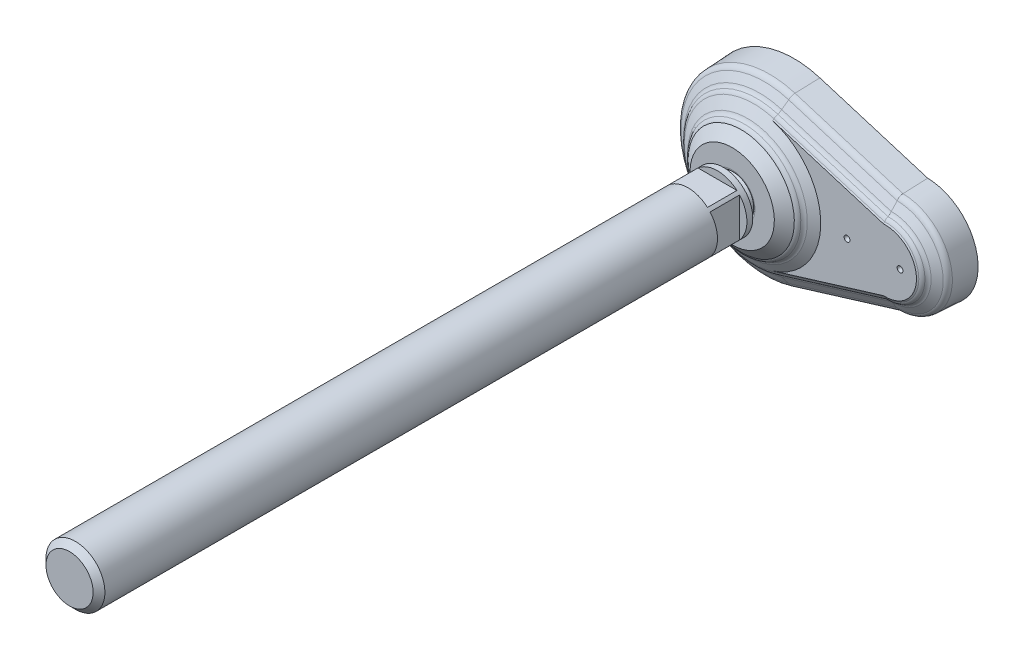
ISO-10303-21;
HEADER;
FILE_DESCRIPTION(('STEP AP214'),'2;1');
FILE_NAME('part.step','',(''),(''),'','','');
FILE_SCHEMA(('AUTOMOTIVE_DESIGN { 1 0 10303 214 1 1 1 1 }'));
ENDSEC;
DATA;
#1=APPLICATION_CONTEXT('core data for automotive mechanical design processes');
#2=APPLICATION_PROTOCOL_DEFINITION('international standard','automotive_design',2000,#1);
#3=PRODUCT_CONTEXT('',#1,'mechanical');
#4=PRODUCT('Part','Part','',(#3));
#5=PRODUCT_RELATED_PRODUCT_CATEGORY('part','',(#4));
#6=PRODUCT_DEFINITION_FORMATION('','',#4);
#7=PRODUCT_DEFINITION_CONTEXT('part definition',#1,'design');
#8=PRODUCT_DEFINITION('design','',#6,#7);
#9=PRODUCT_DEFINITION_SHAPE('','',#8);
#10=(LENGTH_UNIT() NAMED_UNIT(*) SI_UNIT(.MILLI.,.METRE.));
#11=(NAMED_UNIT(*) PLANE_ANGLE_UNIT() SI_UNIT($,.RADIAN.));
#12=(NAMED_UNIT(*) SI_UNIT($,.STERADIAN.) SOLID_ANGLE_UNIT());
#13=UNCERTAINTY_MEASURE_WITH_UNIT(LENGTH_MEASURE(1.E-05),#10,'distance_accuracy_value','');
#14=(GEOMETRIC_REPRESENTATION_CONTEXT(3) GLOBAL_UNCERTAINTY_ASSIGNED_CONTEXT((#13)) GLOBAL_UNIT_ASSIGNED_CONTEXT((#10,
#11,#12)) REPRESENTATION_CONTEXT('',''));
#15=CARTESIAN_POINT('',(0.,0.,0.));
#16=DIRECTION('',(0.,0.,1.));
#17=DIRECTION('',(1.,0.,0.));
#18=AXIS2_PLACEMENT_3D('',#15,#16,#17);
#19=CARTESIAN_POINT('',(0.,0.,36.));
#20=DIRECTION('',(0.,0.,1.));
#21=DIRECTION('',(-1.,0.,0.));
#22=AXIS2_PLACEMENT_3D('',#19,#20,#21);
#23=CYLINDRICAL_SURFACE('',#22,10.);
#24=CARTESIAN_POINT('',(0.,0.,244.));
#25=DIRECTION('',(0.,0.,1.));
#26=DIRECTION('',(-1.,0.,0.));
#27=AXIS2_PLACEMENT_3D('',#24,#25,#26);
#28=CIRCLE('',#27,10.);
#29=CARTESIAN_POINT('',(-10.,0.,244.));
#30=VERTEX_POINT('',#29);
#31=EDGE_CURVE('E9',#30,#30,#28,.F.);
#32=ORIENTED_EDGE('',*,*,#31,.T.);
#33=EDGE_LOOP('',(#32));
#34=FACE_BOUND('',#33,.T.);
#35=DIRECTION('',(0.,0.,1.));
#36=VECTOR('',#35,1.);
#37=CARTESIAN_POINT('',(7.5,-6.61437827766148,36.));
#38=LINE('',#37,#36);
#39=CARTESIAN_POINT('',(7.5,-6.61437827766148,36.));
#40=VERTEX_POINT('',#39);
#41=CARTESIAN_POINT('',(7.5,-6.61437827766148,26.));
#42=VERTEX_POINT('',#41);
#43=EDGE_CURVE('E517',#40,#42,#38,.F.);
#44=ORIENTED_EDGE('',*,*,#43,.F.);
#45=CARTESIAN_POINT('',(0.,0.,36.));
#46=DIRECTION('',(0.,0.,1.));
#47=DIRECTION('',(0.,-1.,0.));
#48=AXIS2_PLACEMENT_3D('',#45,#46,#47);
#49=CIRCLE('',#48,10.);
#50=CARTESIAN_POINT('',(7.5,6.61437827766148,36.));
#51=VERTEX_POINT('',#50);
#52=EDGE_CURVE('E207',#40,#51,#49,.T.);
#53=ORIENTED_EDGE('',*,*,#52,.T.);
#54=DIRECTION('',(0.,0.,1.));
#55=VECTOR('',#54,1.);
#56=CARTESIAN_POINT('',(7.5,6.61437827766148,36.));
#57=LINE('',#56,#55);
#58=CARTESIAN_POINT('',(7.5,6.61437827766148,26.));
#59=VERTEX_POINT('',#58);
#60=EDGE_CURVE('E182',#59,#51,#57,.T.);
#61=ORIENTED_EDGE('',*,*,#60,.F.);
#62=CARTESIAN_POINT('',(0.,0.,26.));
#63=DIRECTION('',(0.,0.,1.));
#64=DIRECTION('',(0.,-1.,0.));
#65=AXIS2_PLACEMENT_3D('',#62,#63,#64);
#66=CIRCLE('',#65,10.);
#67=EDGE_CURVE('E161',#42,#59,#66,.T.);
#68=ORIENTED_EDGE('',*,*,#67,.F.);
#69=EDGE_LOOP('',(#44,#53,#61,#68));
#70=FACE_BOUND('',#69,.T.);
#71=DIRECTION('',(0.,0.,1.));
#72=VECTOR('',#71,1.);
#73=CARTESIAN_POINT('',(6.61437827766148,7.5,36.));
#74=LINE('',#73,#72);
#75=CARTESIAN_POINT('',(6.61437827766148,7.5,36.));
#76=VERTEX_POINT('',#75);
#77=CARTESIAN_POINT('',(6.61437827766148,7.5,26.));
#78=VERTEX_POINT('',#77);
#79=EDGE_CURVE('E169',#76,#78,#74,.F.);
#80=ORIENTED_EDGE('',*,*,#79,.F.);
#81=CARTESIAN_POINT('',(-6.61437827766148,7.5,36.));
#82=VERTEX_POINT('',#81);
#83=EDGE_CURVE('E176',#76,#82,#49,.T.);
#84=ORIENTED_EDGE('',*,*,#83,.T.);
#85=DIRECTION('',(0.,0.,1.));
#86=VECTOR('',#85,1.);
#87=CARTESIAN_POINT('',(-6.61437827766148,7.5,36.));
#88=LINE('',#87,#86);
#89=CARTESIAN_POINT('',(-6.61437827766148,7.5,26.));
#90=VERTEX_POINT('',#89);
#91=EDGE_CURVE('E168',#90,#82,#88,.T.);
#92=ORIENTED_EDGE('',*,*,#91,.F.);
#93=EDGE_CURVE('E154',#78,#90,#66,.T.);
#94=ORIENTED_EDGE('',*,*,#93,.F.);
#95=EDGE_LOOP('',(#80,#84,#92,#94));
#96=FACE_BOUND('',#95,.T.);
#97=DIRECTION('',(0.,0.,1.));
#98=VECTOR('',#97,1.);
#99=CARTESIAN_POINT('',(-7.5,6.61437827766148,36.));
#100=LINE('',#99,#98);
#101=CARTESIAN_POINT('',(-7.5,6.61437827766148,36.));
#102=VERTEX_POINT('',#101);
#103=CARTESIAN_POINT('',(-7.5,6.61437827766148,26.));
#104=VERTEX_POINT('',#103);
#105=EDGE_CURVE('E177',#102,#104,#100,.F.);
#106=ORIENTED_EDGE('',*,*,#105,.F.);
#107=CARTESIAN_POINT('',(-7.5,-6.61437827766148,36.));
#108=VERTEX_POINT('',#107);
#109=EDGE_CURVE('E553',#102,#108,#49,.T.);
#110=ORIENTED_EDGE('',*,*,#109,.T.);
#111=DIRECTION('',(0.,0.,1.));
#112=VECTOR('',#111,1.);
#113=CARTESIAN_POINT('',(-7.5,-6.61437827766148,36.));
#114=LINE('',#113,#112);
#115=CARTESIAN_POINT('',(-7.5,-6.61437827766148,26.));
#116=VERTEX_POINT('',#115);
#117=EDGE_CURVE('E180',#116,#108,#114,.T.);
#118=ORIENTED_EDGE('',*,*,#117,.F.);
#119=EDGE_CURVE('E30',#104,#116,#66,.T.);
#120=ORIENTED_EDGE('',*,*,#119,.F.);
#121=EDGE_LOOP('',(#106,#110,#118,#120));
#122=FACE_BOUND('',#121,.T.);
#123=CARTESIAN_POINT('',(0.,0.,24.));
#124=DIRECTION('',(0.,0.,1.));
#125=DIRECTION('',(-1.,0.,0.));
#126=AXIS2_PLACEMENT_3D('',#123,#124,#125);
#127=CIRCLE('',#126,10.);
#128=CARTESIAN_POINT('',(-10.,0.,24.));
#129=VERTEX_POINT('',#128);
#130=EDGE_CURVE('E504',#129,#129,#127,.T.);
#131=ORIENTED_EDGE('',*,*,#130,.T.);
#132=EDGE_LOOP('',(#131));
#133=FACE_BOUND('',#132,.T.);
#134=CARTESIAN_POINT('',(-6.61437827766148,-7.5,36.));
#135=VERTEX_POINT('',#134);
#136=CARTESIAN_POINT('',(6.61437827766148,-7.5,36.));
#137=VERTEX_POINT('',#136);
#138=EDGE_CURVE('E548',#135,#137,#49,.T.);
#139=ORIENTED_EDGE('',*,*,#138,.T.);
#140=DIRECTION('',(0.,0.,1.));
#141=VECTOR('',#140,1.);
#142=CARTESIAN_POINT('',(6.61437827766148,-7.5,36.));
#143=LINE('',#142,#141);
#144=CARTESIAN_POINT('',(6.61437827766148,-7.5,26.));
#145=VERTEX_POINT('',#144);
#146=EDGE_CURVE('E512',#145,#137,#143,.T.);
#147=ORIENTED_EDGE('',*,*,#146,.F.);
#148=CARTESIAN_POINT('',(-6.61437827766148,-7.5,26.));
#149=VERTEX_POINT('',#148);
#150=EDGE_CURVE('E192',#149,#145,#66,.T.);
#151=ORIENTED_EDGE('',*,*,#150,.F.);
#152=DIRECTION('',(0.,0.,1.));
#153=VECTOR('',#152,1.);
#154=CARTESIAN_POINT('',(-6.61437827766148,-7.5,36.));
#155=LINE('',#154,#153);
#156=EDGE_CURVE('E135',#135,#149,#155,.F.);
#157=ORIENTED_EDGE('',*,*,#156,.F.);
#158=EDGE_LOOP('',(#139,#147,#151,#157));
#159=FACE_BOUND('',#158,.T.);
#160=ADVANCED_FACE('F14',(#34,#70,#96,#122,#133,#159),#23,.T.);
#161=CARTESIAN_POINT('',(0.,0.,17.6309999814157));
#162=DIRECTION('',(0.,0.,1.));
#163=DIRECTION('',(-1.,0.,0.));
#164=AXIS2_PLACEMENT_3D('',#161,#162,#163);
#165=DEGENERATE_TOROIDAL_SURFACE('',#164,0.0005038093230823,6.829,.T.);
#166=CARTESIAN_POINT('',(0.,0.,18.775));
#167=DIRECTION('',(0.,0.,-1.));
#168=DIRECTION('',(1.,0.,0.));
#169=AXIS2_PLACEMENT_3D('',#166,#167,#168);
#170=CIRCLE('',#169,6.733);
#171=CARTESIAN_POINT('',(6.733,0.,18.775));
#172=VERTEX_POINT('',#171);
#173=EDGE_CURVE('E200',#172,#172,#170,.T.);
#174=ORIENTED_EDGE('',*,*,#173,.F.);
#175=EDGE_LOOP('',(#174));
#176=FACE_BOUND('',#175,.T.);
#177=CARTESIAN_POINT('',(0.,0.,22.));
#178=DIRECTION('',(0.,0.,1.));
#179=DIRECTION('',(-1.,0.,0.));
#180=AXIS2_PLACEMENT_3D('',#177,#178,#179);
#181=CIRCLE('',#180,5.24903501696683);
#182=CARTESIAN_POINT('',(-5.24903501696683,0.,22.));
#183=VERTEX_POINT('',#182);
#184=EDGE_CURVE('E497',#183,#183,#181,.T.);
#185=ORIENTED_EDGE('',*,*,#184,.F.);
#186=EDGE_LOOP('',(#185));
#187=FACE_BOUND('',#186,.T.);
#188=ADVANCED_FACE('F410',(#176,#187),#165,.T.);
#189=CARTESIAN_POINT('',(0.,0.,36.));
#190=DIRECTION('',(0.,0.,1.));
#191=DIRECTION('',(-1.,0.,0.));
#192=AXIS2_PLACEMENT_3D('',#189,#190,#191);
#193=CYLINDRICAL_SURFACE('',#192,5.24903501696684);
#194=CARTESIAN_POINT('',(0.,0.,24.));
#195=DIRECTION('',(0.,0.,1.));
#196=DIRECTION('',(-1.,0.,0.));
#197=AXIS2_PLACEMENT_3D('',#194,#195,#196);
#198=CIRCLE('',#197,5.24903501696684);
#199=CARTESIAN_POINT('',(-5.24903501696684,0.,24.));
#200=VERTEX_POINT('',#199);
#201=EDGE_CURVE('E500',#200,#200,#198,.T.);
#202=ORIENTED_EDGE('',*,*,#201,.F.);
#203=EDGE_LOOP('',(#202));
#204=FACE_BOUND('',#203,.T.);
#205=ORIENTED_EDGE('',*,*,#184,.T.);
#206=EDGE_LOOP('',(#205));
#207=FACE_BOUND('',#206,.T.);
#208=ADVANCED_FACE('F417',(#204,#207),#193,.T.);
#209=CARTESIAN_POINT('',(-5.24903501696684,0.,24.));
#210=DIRECTION('',(0.,0.,1.));
#211=DIRECTION('',(-1.,0.,0.));
#212=AXIS2_PLACEMENT_3D('',#209,#210,#211);
#213=PLANE('',#212);
#214=ORIENTED_EDGE('',*,*,#130,.F.);
#215=EDGE_LOOP('',(#214));
#216=FACE_BOUND('',#215,.T.);
#217=ORIENTED_EDGE('',*,*,#201,.T.);
#218=EDGE_LOOP('',(#217));
#219=FACE_BOUND('',#218,.T.);
#220=ADVANCED_FACE('F891',(#216,#219),#213,.F.);
#221=CARTESIAN_POINT('',(-7.5,-7.5,26.));
#222=DIRECTION('',(0.,-1.,0.));
#223=DIRECTION('',(1.,0.,0.));
#224=AXIS2_PLACEMENT_3D('',#221,#222,#223);
#225=PLANE('',#224);
#226=ORIENTED_EDGE('',*,*,#146,.T.);
#227=DIRECTION('',(-1.,0.,0.));
#228=VECTOR('',#227,1.);
#229=CARTESIAN_POINT('',(-10.,-7.5,36.));
#230=LINE('',#229,#228);
#231=EDGE_CURVE('E499',#137,#135,#230,.T.);
#232=ORIENTED_EDGE('',*,*,#231,.T.);
#233=ORIENTED_EDGE('',*,*,#156,.T.);
#234=DIRECTION('',(1.,0.,0.));
#235=VECTOR('',#234,1.);
#236=CARTESIAN_POINT('',(-7.5,-7.5,26.));
#237=LINE('',#236,#235);
#238=EDGE_CURVE('E560',#149,#145,#237,.T.);
#239=ORIENTED_EDGE('',*,*,#238,.T.);
#240=EDGE_LOOP('',(#226,#232,#233,#239));
#241=FACE_BOUND('',#240,.T.);
#242=ADVANCED_FACE('F556',(#241),#225,.T.);
#243=CARTESIAN_POINT('',(0.,0.,26.));
#244=DIRECTION('',(0.,0.,1.));
#245=DIRECTION('',(0.,-1.,0.));
#246=AXIS2_PLACEMENT_3D('',#243,#244,#245);
#247=PLANE('',#246);
#248=ORIENTED_EDGE('',*,*,#150,.T.);
#249=ORIENTED_EDGE('',*,*,#238,.F.);
#250=EDGE_LOOP('',(#248,#249));
#251=FACE_BOUND('',#250,.T.);
#252=ADVANCED_FACE('F559',(#251),#247,.T.);
#253=CARTESIAN_POINT('',(7.5,-7.5,26.));
#254=DIRECTION('',(1.,0.,0.));
#255=DIRECTION('',(0.,1.,0.));
#256=AXIS2_PLACEMENT_3D('',#253,#254,#255);
#257=PLANE('',#256);
#258=ORIENTED_EDGE('',*,*,#60,.T.);
#259=DIRECTION('',(0.,-1.,0.));
#260=VECTOR('',#259,1.);
#261=CARTESIAN_POINT('',(7.5,0.,36.));
#262=LINE('',#261,#260);
#263=EDGE_CURVE('E502',#51,#40,#262,.T.);
#264=ORIENTED_EDGE('',*,*,#263,.T.);
#265=ORIENTED_EDGE('',*,*,#43,.T.);
#266=DIRECTION('',(0.,1.,0.));
#267=VECTOR('',#266,1.);
#268=CARTESIAN_POINT('',(7.5,-7.5,26.));
#269=LINE('',#268,#267);
#270=EDGE_CURVE('E171',#42,#59,#269,.T.);
#271=ORIENTED_EDGE('',*,*,#270,.T.);
#272=EDGE_LOOP('',(#258,#264,#265,#271));
#273=FACE_BOUND('',#272,.T.);
#274=ADVANCED_FACE('F866',(#273),#257,.T.);
#275=ORIENTED_EDGE('',*,*,#67,.T.);
#276=ORIENTED_EDGE('',*,*,#270,.F.);
#277=EDGE_LOOP('',(#275,#276));
#278=FACE_BOUND('',#277,.T.);
#279=ADVANCED_FACE('F850',(#278),#247,.T.);
#280=CARTESIAN_POINT('',(7.5,7.5,26.));
#281=DIRECTION('',(0.,1.,0.));
#282=DIRECTION('',(-1.,0.,0.));
#283=AXIS2_PLACEMENT_3D('',#280,#281,#282);
#284=PLANE('',#283);
#285=ORIENTED_EDGE('',*,*,#91,.T.);
#286=DIRECTION('',(1.,0.,0.));
#287=VECTOR('',#286,1.);
#288=CARTESIAN_POINT('',(-10.,7.5,36.));
#289=LINE('',#288,#287);
#290=EDGE_CURVE('E193',#82,#76,#289,.T.);
#291=ORIENTED_EDGE('',*,*,#290,.T.);
#292=ORIENTED_EDGE('',*,*,#79,.T.);
#293=DIRECTION('',(-1.,0.,0.));
#294=VECTOR('',#293,1.);
#295=CARTESIAN_POINT('',(7.5,7.5,26.));
#296=LINE('',#295,#294);
#297=EDGE_CURVE('E157',#78,#90,#296,.T.);
#298=ORIENTED_EDGE('',*,*,#297,.T.);
#299=EDGE_LOOP('',(#285,#291,#292,#298));
#300=FACE_BOUND('',#299,.T.);
#301=ADVANCED_FACE('F165',(#300),#284,.T.);
#302=ORIENTED_EDGE('',*,*,#93,.T.);
#303=ORIENTED_EDGE('',*,*,#297,.F.);
#304=EDGE_LOOP('',(#302,#303));
#305=FACE_BOUND('',#304,.T.);
#306=ADVANCED_FACE('F156',(#305),#247,.T.);
#307=DIRECTION('',(0.,-1.,0.));
#308=VECTOR('',#307,1.);
#309=CARTESIAN_POINT('',(-7.5,7.5,26.));
#310=LINE('',#309,#308);
#311=EDGE_CURVE('E170',#104,#116,#310,.T.);
#312=ORIENTED_EDGE('',*,*,#311,.F.);
#313=ORIENTED_EDGE('',*,*,#119,.T.);
#314=EDGE_LOOP('',(#312,#313));
#315=FACE_BOUND('',#314,.T.);
#316=ADVANCED_FACE('F834',(#315),#247,.T.);
#317=CARTESIAN_POINT('',(-7.5,7.5,26.));
#318=DIRECTION('',(-1.,0.,0.));
#319=DIRECTION('',(0.,-1.,0.));
#320=AXIS2_PLACEMENT_3D('',#317,#318,#319);
#321=PLANE('',#320);
#322=ORIENTED_EDGE('',*,*,#117,.T.);
#323=DIRECTION('',(0.,1.,0.));
#324=VECTOR('',#323,1.);
#325=CARTESIAN_POINT('',(-7.5,0.,36.));
#326=LINE('',#325,#324);
#327=EDGE_CURVE('E189',#108,#102,#326,.T.);
#328=ORIENTED_EDGE('',*,*,#327,.T.);
#329=ORIENTED_EDGE('',*,*,#105,.T.);
#330=ORIENTED_EDGE('',*,*,#311,.T.);
#331=EDGE_LOOP('',(#322,#328,#329,#330));
#332=FACE_BOUND('',#331,.T.);
#333=ADVANCED_FACE('F430',(#332),#321,.T.);
#334=CARTESIAN_POINT('',(45.,0.,0.));
#335=DIRECTION('',(0.,0.,-1.));
#336=DIRECTION('',(0.,1.,0.));
#337=AXIS2_PLACEMENT_3D('',#334,#335,#336);
#338=CONICAL_SURFACE('',#337,17.5,0.0523365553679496);
#339=CARTESIAN_POINT('',(45.,0.,8.304));
#340=DIRECTION('',(0.,0.,1.));
#341=DIRECTION('',(0.,-1.,0.));
#342=AXIS2_PLACEMENT_3D('',#339,#340,#341);
#343=CIRCLE('',#342,17.065);
#344=CARTESIAN_POINT('',(45.3136024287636,-17.0621182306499,8.304));
#345=VERTEX_POINT('',#344);
#346=CARTESIAN_POINT('',(45.3136024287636,17.0621182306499,8.304));
#347=VERTEX_POINT('',#346);
#348=EDGE_CURVE('E245',#345,#347,#343,.T.);
#349=ORIENTED_EDGE('',*,*,#348,.F.);
#350=CARTESIAN_POINT('',(45.3136007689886,-17.0621077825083,8.3042));
#351=CARTESIAN_POINT('',(45.3250873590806,-17.134412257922,6.92013380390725));
#352=CARTESIAN_POINT('',(45.3366049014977,-17.206707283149,5.5360673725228));
#353=CARTESIAN_POINT('',(45.3597018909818,-17.3512784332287,2.76793403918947));
#354=CARTESIAN_POINT('',(45.3712813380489,-17.4235545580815,1.38386713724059));
#355=CARTESIAN_POINT('',(45.3828917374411,-17.4958212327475,-0.000200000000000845));
#356=B_SPLINE_CURVE_WITH_KNOTS('',3,(#350,#351,#352,#353,#354,#355),.UNSPECIFIED.,.F.,.F.,(4,2,
4),(0.,4.15800336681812,8.31600673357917),.UNSPECIFIED.);
#357=CARTESIAN_POINT('',(45.3828900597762,-17.4958107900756,0.));
#358=VERTEX_POINT('',#357);
#359=EDGE_CURVE('E964',#345,#358,#356,.T.);
#360=ORIENTED_EDGE('',*,*,#359,.T.);
#361=CARTESIAN_POINT('',(45.,0.,0.));
#362=DIRECTION('',(0.,0.,1.));
#363=DIRECTION('',(0.,-1.,0.));
#364=AXIS2_PLACEMENT_3D('',#361,#362,#363);
#365=CIRCLE('',#364,17.5);
#366=CARTESIAN_POINT('',(45.3828900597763,17.4958107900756,0.));
#367=VERTEX_POINT('',#366);
#368=EDGE_CURVE('E248',#358,#367,#365,.T.);
#369=ORIENTED_EDGE('',*,*,#368,.T.);
#370=CARTESIAN_POINT('',(45.3828917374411,17.4958212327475,-0.000200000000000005));
#371=CARTESIAN_POINT('',(45.371281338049,17.4235545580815,1.38386713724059));
#372=CARTESIAN_POINT('',(45.359701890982,17.3512784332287,2.76793403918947));
#373=CARTESIAN_POINT('',(45.3366049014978,17.206707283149,5.5360673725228));
#374=CARTESIAN_POINT('',(45.3250873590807,17.134412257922,6.92013380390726));
#375=CARTESIAN_POINT('',(45.3136007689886,17.0621077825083,8.3042));
#376=B_SPLINE_CURVE_WITH_KNOTS('',3,(#370,#371,#372,#373,#374,#375),.UNSPECIFIED.,.F.,.F.,(4,2,
4),(0.,4.15800336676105,8.31600673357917),.UNSPECIFIED.);
#377=EDGE_CURVE('E957',#367,#347,#376,.T.);
#378=ORIENTED_EDGE('',*,*,#377,.T.);
#379=EDGE_LOOP('',(#349,#360,#369,#378));
#380=FACE_BOUND('',#379,.T.);
#381=ADVANCED_FACE('F306',(#380),#338,.T.);
#382=CARTESIAN_POINT('',(46.8961596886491,-16.5782819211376,8.304));
#383=DIRECTION('',(-0.291971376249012,0.9549953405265,-0.0523126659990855));
#384=DIRECTION('',(-0.956304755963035,-0.292371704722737,0.));
#385=AXIS2_PLACEMENT_3D('',#382,#383,#384);
#386=PLANE('',#385);
#387=ORIENTED_EDGE('',*,*,#359,.F.);
#388=DIRECTION('',(-0.956304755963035,-0.292371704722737,0.));
#389=VECTOR('',#388,1.);
#390=CARTESIAN_POINT('',(46.8961596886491,-16.5782819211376,8.304));
#391=LINE('',#390,#389);
#392=CARTESIAN_POINT('',(8.64396945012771,-28.2731501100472,8.304));
#393=VERTEX_POINT('',#392);
#394=EDGE_CURVE('E989',#345,#393,#391,.T.);
#395=ORIENTED_EDGE('',*,*,#394,.T.);
#396=DIRECTION('',(-0.0152947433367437,0.050026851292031,0.998630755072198));
#397=VECTOR('',#396,1.);
#398=CARTESIAN_POINT('',(8.7711511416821,-28.689142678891,0.));
#399=LINE('',#398,#397);
#400=CARTESIAN_POINT('',(8.7711511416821,-28.689142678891,0.));
#401=VERTEX_POINT('',#400);
#402=EDGE_CURVE('E1002',#401,#393,#399,.T.);
#403=ORIENTED_EDGE('',*,*,#402,.F.);
#404=DIRECTION('',(-0.956304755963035,-0.292371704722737,0.));
#405=VECTOR('',#404,1.);
#406=CARTESIAN_POINT('',(47.0233413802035,-16.9942744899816,0.));
#407=LINE('',#406,#405);
#408=EDGE_CURVE('E126',#358,#401,#407,.T.);
#409=ORIENTED_EDGE('',*,*,#408,.F.);
#410=EDGE_LOOP('',(#387,#395,#403,#409));
#411=FACE_BOUND('',#410,.T.);
#412=ADVANCED_FACE('F413',(#411),#386,.F.);
#413=CARTESIAN_POINT('',(0.,0.,0.));
#414=DIRECTION('',(0.,0.,1.));
#415=DIRECTION('',(0.,-1.,0.));
#416=AXIS2_PLACEMENT_3D('',#413,#414,#415);
#417=PLANE('',#416);
#418=DIRECTION('',(-0.956304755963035,0.292371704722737,0.));
#419=VECTOR('',#418,1.);
#420=CARTESIAN_POINT('',(47.0233413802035,16.9942744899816,0.));
#421=LINE('',#420,#419);
#422=CARTESIAN_POINT('',(8.7711511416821,28.689142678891,0.));
#423=VERTEX_POINT('',#422);
#424=EDGE_CURVE('E987',#367,#423,#421,.T.);
#425=ORIENTED_EDGE('',*,*,#424,.F.);
#426=ORIENTED_EDGE('',*,*,#368,.F.);
#427=ORIENTED_EDGE('',*,*,#408,.T.);
#428=CARTESIAN_POINT('',(0.,0.,0.));
#429=DIRECTION('',(0.,0.,1.));
#430=DIRECTION('',(0.,-1.,0.));
#431=AXIS2_PLACEMENT_3D('',#428,#429,#430);
#432=CIRCLE('',#431,30.);
#433=EDGE_CURVE('E294',#423,#401,#432,.T.);
#434=ORIENTED_EDGE('',*,*,#433,.F.);
#435=EDGE_LOOP('',(#425,#426,#427,#434));
#436=FACE_BOUND('',#435,.T.);
#437=CARTESIAN_POINT('',(32.,0.,0.));
#438=DIRECTION('',(0.,0.,-1.));
#439=DIRECTION('',(0.,1.,0.));
#440=AXIS2_PLACEMENT_3D('',#437,#438,#439);
#441=CIRCLE('',#440,4.25);
#442=CARTESIAN_POINT('',(32.,4.25,0.));
#443=VERTEX_POINT('',#442);
#444=EDGE_CURVE('E554',#443,#443,#441,.T.);
#445=ORIENTED_EDGE('',*,*,#444,.F.);
#446=EDGE_LOOP('',(#445));
#447=FACE_BOUND('',#446,.T.);
#448=CARTESIAN_POINT('',(50.,0.,0.));
#449=DIRECTION('',(0.,0.,-1.));
#450=DIRECTION('',(0.,1.,0.));
#451=AXIS2_PLACEMENT_3D('',#448,#449,#450);
#452=CIRCLE('',#451,4.25);
#453=CARTESIAN_POINT('',(50.,4.25,0.));
#454=VERTEX_POINT('',#453);
#455=EDGE_CURVE('E942',#454,#454,#452,.T.);
#456=ORIENTED_EDGE('',*,*,#455,.F.);
#457=EDGE_LOOP('',(#456));
#458=FACE_BOUND('',#457,.T.);
#459=ADVANCED_FACE('F304',(#436,#447,#458),#417,.F.);
#460=CARTESIAN_POINT('',(47.0233413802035,16.9942744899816,0.));
#461=DIRECTION('',(-0.291971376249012,-0.9549953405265,-0.0523126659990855));
#462=DIRECTION('',(0.956304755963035,-0.292371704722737,0.));
#463=AXIS2_PLACEMENT_3D('',#460,#461,#462);
#464=PLANE('',#463);
#465=ORIENTED_EDGE('',*,*,#377,.F.);
#466=ORIENTED_EDGE('',*,*,#424,.T.);
#467=DIRECTION('',(-0.0152947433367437,-0.050026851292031,0.998630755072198));
#468=VECTOR('',#467,1.);
#469=CARTESIAN_POINT('',(8.7711511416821,28.689142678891,0.));
#470=LINE('',#469,#468);
#471=CARTESIAN_POINT('',(8.64396945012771,28.2731501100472,8.304));
#472=VERTEX_POINT('',#471);
#473=EDGE_CURVE('E1019',#423,#472,#470,.T.);
#474=ORIENTED_EDGE('',*,*,#473,.T.);
#475=DIRECTION('',(-0.956304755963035,0.292371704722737,0.));
#476=VECTOR('',#475,1.);
#477=CARTESIAN_POINT('',(46.8961596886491,16.5782819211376,8.304));
#478=LINE('',#477,#476);
#479=EDGE_CURVE('E985',#347,#472,#478,.T.);
#480=ORIENTED_EDGE('',*,*,#479,.F.);
#481=EDGE_LOOP('',(#465,#466,#474,#480));
#482=FACE_BOUND('',#481,.T.);
#483=ADVANCED_FACE('F382',(#482),#464,.F.);
#484=CARTESIAN_POINT('',(45.,0.,8.20868962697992));
#485=DIRECTION('',(0.,0.,1.));
#486=DIRECTION('',(0.,-1.,0.));
#487=AXIS2_PLACEMENT_3D('',#484,#485,#486);
#488=TOROIDAL_SURFACE('',#487,15.0672723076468,2.);
#489=CARTESIAN_POINT('',(45.313603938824,-17.062127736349,8.3038));
#490=CARTESIAN_POINT('',(45.3131828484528,-17.0594763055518,8.3596419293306));
#491=CARTESIAN_POINT('',(45.3123906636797,-17.0544900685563,8.41534315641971));
#492=CARTESIAN_POINT('',(45.3100724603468,-17.0398916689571,8.52611669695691));
#493=CARTESIAN_POINT('',(45.3085464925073,-17.0302798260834,8.5811890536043));
#494=CARTESIAN_POINT('',(45.3028875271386,-16.9946160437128,8.7447437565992));
#495=CARTESIAN_POINT('',(45.2976717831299,-16.9617253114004,8.85178061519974));
#496=CARTESIAN_POINT('',(45.284530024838,-16.8786837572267,9.05872519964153));
#497=CARTESIAN_POINT('',(45.2766032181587,-16.8285278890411,9.1586308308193));
#498=CARTESIAN_POINT('',(45.2583029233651,-16.7124179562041,9.34857034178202));
#499=CARTESIAN_POINT('',(45.24792931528,-16.6464631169,9.43860373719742));
#500=CARTESIAN_POINT('',(45.2250216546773,-16.5003240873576,9.60671335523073));
#501=CARTESIAN_POINT('',(45.2124772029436,-16.4200713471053,9.68472843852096));
#502=CARTESIAN_POINT('',(45.1856662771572,-16.2478592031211,9.8261370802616));
#503=CARTESIAN_POINT('',(45.1714009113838,-16.1559073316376,9.88953997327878));
#504=CARTESIAN_POINT('',(45.148748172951,-16.0092275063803,9.97356807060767));
#505=CARTESIAN_POINT('',(45.1408156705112,-15.957749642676,10.0001426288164));
#506=CARTESIAN_POINT('',(45.1246863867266,-15.8528232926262,10.0486569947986));
#507=CARTESIAN_POINT('',(45.1164901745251,-15.7993790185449,10.0706061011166));
#508=CARTESIAN_POINT('',(45.1081834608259,-15.7450737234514,10.0902));
#509=B_SPLINE_CURVE_WITH_KNOTS('',3,(#489,#490,#491,#492,#493,#494,#495,#496,#497,#498,#499,
#500,#501,#502,#503,#504,#505,#506,#507,#508),.UNSPECIFIED.,.F.,.F.,(4,2,2,2,2,2,2,2,2,4),(0.,
0.167615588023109,0.335219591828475,0.669784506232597,1.00444729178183,1.33912648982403,
1.67545571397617,2.01156948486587,2.1867983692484,2.36167155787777),.UNSPECIFIED.);
#510=CARTESIAN_POINT('',(45.108268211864,-15.7456277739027,10.09));
#511=VERTEX_POINT('',#510);
#512=EDGE_CURVE('E965',#345,#511,#509,.T.);
#513=ORIENTED_EDGE('',*,*,#512,.F.);
#514=ORIENTED_EDGE('',*,*,#348,.T.);
#515=CARTESIAN_POINT('',(45.1081834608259,15.7450737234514,10.0902));
#516=CARTESIAN_POINT('',(45.1162755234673,15.7979756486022,10.0711117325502));
#517=CARTESIAN_POINT('',(45.1242625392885,15.8500594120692,10.0497900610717));
#518=CARTESIAN_POINT('',(45.1399729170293,15.9522733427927,10.0028085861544));
#519=CARTESIAN_POINT('',(45.1476962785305,16.0024035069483,9.97714877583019));
#520=CARTESIAN_POINT('',(45.170371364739,16.1492634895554,9.89392549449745));
#521=CARTESIAN_POINT('',(45.1848488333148,16.2425982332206,9.83006921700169));
#522=CARTESIAN_POINT('',(45.2120467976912,16.4173167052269,9.6873614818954));
#523=CARTESIAN_POINT('',(45.2247661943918,16.4986929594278,9.60850071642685));
#524=CARTESIAN_POINT('',(45.2480269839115,16.647087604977,9.4379734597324));
#525=CARTESIAN_POINT('',(45.2585686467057,16.7141077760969,9.34630855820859));
#526=CARTESIAN_POINT('',(45.2770522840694,16.8313730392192,9.15345563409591));
#527=CARTESIAN_POINT('',(45.2850114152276,16.8817288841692,9.05233645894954));
#528=CARTESIAN_POINT('',(45.298151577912,16.9647535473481,8.84294631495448));
#529=CARTESIAN_POINT('',(45.3033350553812,16.9974379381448,8.73468173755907));
#530=CARTESIAN_POINT('',(45.3088197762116,17.0320013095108,8.57167924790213));
#531=CARTESIAN_POINT('',(45.3102579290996,17.0410597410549,8.51840996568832));
#532=CARTESIAN_POINT('',(45.3124461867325,17.0548396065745,8.41140374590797));
#533=CARTESIAN_POINT('',(45.3131976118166,17.0595693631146,8.35766790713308));
#534=CARTESIAN_POINT('',(45.313603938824,17.062127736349,8.3038));
#535=B_SPLINE_CURVE_WITH_KNOTS('',3,(#515,#516,#517,#518,#519,#520,#521,#522,#523,#524,#525,
#526,#527,#528,#529,#530,#531,#532,#533,#534),.UNSPECIFIED.,.F.,.F.,(4,2,2,2,2,2,2,2,2,4),(0.,
0.170355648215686,0.340711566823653,0.680992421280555,1.02148505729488,1.36193545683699,
1.70007548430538,2.03791704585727,2.19992239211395,2.36161559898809),.UNSPECIFIED.);
#536=CARTESIAN_POINT('',(45.1082682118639,15.7456277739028,10.09));
#537=VERTEX_POINT('',#536);
#538=EDGE_CURVE('E371',#537,#347,#535,.T.);
#539=ORIENTED_EDGE('',*,*,#538,.F.);
#540=CARTESIAN_POINT('',(45.,0.,10.09));
#541=DIRECTION('',(0.,0.,1.));
#542=DIRECTION('',(0.,-1.,0.));
#543=AXIS2_PLACEMENT_3D('',#540,#541,#542);
#544=CIRCLE('',#543,15.746);
#545=EDGE_CURVE('E242',#511,#537,#544,.T.);
#546=ORIENTED_EDGE('',*,*,#545,.F.);
#547=EDGE_LOOP('',(#513,#514,#539,#546));
#548=FACE_BOUND('',#547,.T.);
#549=ADVANCED_FACE('F355',(#548),#488,.T.);
#550=CARTESIAN_POINT('',(46.312080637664,-14.6678454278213,8.20868962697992));
#551=DIRECTION('',(-0.956304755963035,-0.292371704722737,0.));
#552=DIRECTION('',(0.292371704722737,-0.956304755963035,0.));
#553=AXIS2_PLACEMENT_3D('',#550,#551,#552);
#554=CYLINDRICAL_SURFACE('',#553,2.);
#555=ORIENTED_EDGE('',*,*,#394,.F.);
#556=ORIENTED_EDGE('',*,*,#512,.T.);
#557=DIRECTION('',(-0.956304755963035,-0.292371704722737,0.));
#558=VECTOR('',#557,1.);
#559=CARTESIAN_POINT('',(46.5105214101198,-15.3169159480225,10.09));
#560=LINE('',#559,#558);
#561=CARTESIAN_POINT('',(8.25833117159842,-27.0117841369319,10.09));
#562=VERTEX_POINT('',#561);
#563=EDGE_CURVE('E991',#511,#562,#560,.T.);
#564=ORIENTED_EDGE('',*,*,#563,.T.);
#565=CARTESIAN_POINT('',(8.05989039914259,-26.3627136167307,8.20868962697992));
#566=DIRECTION('',(0.956304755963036,0.292371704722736,0.));
#567=DIRECTION('',(-0.292371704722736,0.956304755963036,0.));
#568=AXIS2_PLACEMENT_3D('',#565,#566,#567);
#569=CIRCLE('',#568,2.);
#570=EDGE_CURVE('E1005',#562,#393,#569,.T.);
#571=ORIENTED_EDGE('',*,*,#570,.T.);
#572=EDGE_LOOP('',(#555,#556,#564,#571));
#573=FACE_BOUND('',#572,.T.);
#574=ADVANCED_FACE('F383',(#573),#554,.T.);
#575=CARTESIAN_POINT('',(0.,0.,0.));
#576=DIRECTION('',(0.,0.,-1.));
#577=DIRECTION('',(0.,1.,0.));
#578=AXIS2_PLACEMENT_3D('',#575,#576,#577);
#579=CONICAL_SURFACE('',#578,30.,0.0523365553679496);
#580=CARTESIAN_POINT('',(0.,0.,8.304));
#581=DIRECTION('',(0.,0.,1.));
#582=DIRECTION('',(0.,-1.,0.));
#583=AXIS2_PLACEMENT_3D('',#580,#581,#582);
#584=CIRCLE('',#583,29.565);
#585=EDGE_CURVE('E1048',#472,#393,#584,.T.);
#586=ORIENTED_EDGE('',*,*,#585,.F.);
#587=ORIENTED_EDGE('',*,*,#473,.F.);
#588=ORIENTED_EDGE('',*,*,#433,.T.);
#589=ORIENTED_EDGE('',*,*,#402,.T.);
#590=EDGE_LOOP('',(#586,#587,#588,#589));
#591=FACE_BOUND('',#590,.T.);
#592=ADVANCED_FACE('F403',(#591),#579,.T.);
#593=CARTESIAN_POINT('',(46.312080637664,14.6678454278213,8.20868962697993));
#594=DIRECTION('',(-0.956304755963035,0.292371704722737,0.));
#595=DIRECTION('',(-0.292371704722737,-0.956304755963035,0.));
#596=AXIS2_PLACEMENT_3D('',#593,#594,#595);
#597=CYLINDRICAL_SURFACE('',#596,2.);
#598=DIRECTION('',(-0.956304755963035,0.292371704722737,0.));
#599=VECTOR('',#598,1.);
#600=CARTESIAN_POINT('',(46.5105214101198,15.3169159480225,10.09));
#601=LINE('',#600,#599);
#602=CARTESIAN_POINT('',(8.25833117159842,27.0117841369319,10.09));
#603=VERTEX_POINT('',#602);
#604=EDGE_CURVE('E983',#537,#603,#601,.T.);
#605=ORIENTED_EDGE('',*,*,#604,.F.);
#606=ORIENTED_EDGE('',*,*,#538,.T.);
#607=ORIENTED_EDGE('',*,*,#479,.T.);
#608=CARTESIAN_POINT('',(8.05989039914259,26.3627136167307,8.20868962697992));
#609=DIRECTION('',(-0.956304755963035,0.292371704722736,0.));
#610=DIRECTION('',(-0.292371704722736,-0.956304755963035,0.));
#611=AXIS2_PLACEMENT_3D('',#608,#609,#610);
#612=CIRCLE('',#611,2.);
#613=EDGE_CURVE('E1022',#603,#472,#612,.T.);
#614=ORIENTED_EDGE('',*,*,#613,.F.);
#615=EDGE_LOOP('',(#605,#606,#607,#614));
#616=FACE_BOUND('',#615,.T.);
#617=ADVANCED_FACE('F314',(#616),#597,.T.);
#618=CARTESIAN_POINT('',(45.,0.,10.09));
#619=DIRECTION('',(0.,0.,-1.));
#620=DIRECTION('',(0.,1.,0.));
#621=AXIS2_PLACEMENT_3D('',#618,#619,#620);
#622=CONICAL_SURFACE('',#621,15.746,0.993858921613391);
#623=CARTESIAN_POINT('',(45.,0.,11.7170000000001));
#624=DIRECTION('',(0.,0.,1.));
#625=DIRECTION('',(0.,-1.,0.));
#626=AXIS2_PLACEMENT_3D('',#623,#624,#625);
#627=CIRCLE('',#626,13.2459999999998);
#628=CARTESIAN_POINT('',(44.7416637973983,-13.243480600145,11.7170000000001));
#629=VERTEX_POINT('',#628);
#630=CARTESIAN_POINT('',(44.7416637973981,13.2434806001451,11.7170000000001));
#631=VERTEX_POINT('',#630);
#632=EDGE_CURVE('E240',#629,#631,#627,.T.);
#633=ORIENTED_EDGE('',*,*,#632,.F.);
#634=CARTESIAN_POINT('',(44.7416208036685,-13.2431723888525,11.7172000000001));
#635=CARTESIAN_POINT('',(44.8000092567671,-13.66082442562,11.4461588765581));
#636=CARTESIAN_POINT('',(44.8597613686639,-14.078214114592,11.1750215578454));
#637=CARTESIAN_POINT('',(44.9819928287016,-14.9124682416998,10.6325548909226));
#638=CARTESIAN_POINT('',(45.0444721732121,-15.3293326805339,10.3612255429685));
#639=CARTESIAN_POINT('',(45.1083151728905,-15.745934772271,10.0898));
#640=B_SPLINE_CURVE_WITH_KNOTS('',3,(#634,#635,#636,#637,#638,#639),.UNSPECIFIED.,.F.,.F.,(4,2,
4),(0.,1.50389468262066,3.0077873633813),.UNSPECIFIED.);
#641=EDGE_CURVE('E364',#629,#511,#640,.T.);
#642=ORIENTED_EDGE('',*,*,#641,.T.);
#643=ORIENTED_EDGE('',*,*,#545,.T.);
#644=CARTESIAN_POINT('',(45.1083151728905,15.745934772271,10.0898));
#645=CARTESIAN_POINT('',(45.0444721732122,15.3293326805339,10.3612255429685));
#646=CARTESIAN_POINT('',(44.9819928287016,14.9124682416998,10.6325548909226));
#647=CARTESIAN_POINT('',(44.8597613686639,14.078214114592,11.1750215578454));
#648=CARTESIAN_POINT('',(44.8000092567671,13.66082442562,11.4461588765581));
#649=CARTESIAN_POINT('',(44.7416208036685,13.2431723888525,11.7172000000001));
#650=B_SPLINE_CURVE_WITH_KNOTS('',3,(#644,#645,#646,#647,#648,#649),.UNSPECIFIED.,.F.,.F.,(4,2,
4),(0.,1.50389268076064,3.0077873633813),.UNSPECIFIED.);
#651=EDGE_CURVE('E358',#537,#631,#650,.T.);
#652=ORIENTED_EDGE('',*,*,#651,.T.);
#653=EDGE_LOOP('',(#633,#642,#643,#652));
#654=FACE_BOUND('',#653,.T.);
#655=ADVANCED_FACE('F349',(#654),#622,.T.);
#656=CARTESIAN_POINT('',(45.7795921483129,-12.9261540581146,11.7170000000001));
#657=DIRECTION('',(-0.159476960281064,0.521625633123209,-0.838137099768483));
#658=DIRECTION('',(0.,0.849002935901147,0.528388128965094));
#659=AXIS2_PLACEMENT_3D('',#656,#657,#658);
#660=PLANE('',#659);
#661=ORIENTED_EDGE('',*,*,#641,.F.);
#662=DIRECTION('',(-0.956304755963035,-0.292371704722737,0.));
#663=VECTOR('',#662,1.);
#664=CARTESIAN_POINT('',(45.7795921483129,-12.9261540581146,11.7170000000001));
#665=LINE('',#664,#663);
#666=CARTESIAN_POINT('',(7.52740190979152,-24.6210222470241,11.7170000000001));
#667=VERTEX_POINT('',#666);
#668=EDGE_CURVE('E993',#629,#667,#665,.T.);
#669=ORIENTED_EDGE('',*,*,#668,.T.);
#670=DIRECTION('',(-0.245047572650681,0.801514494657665,0.545459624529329));
#671=VECTOR('',#670,1.);
#672=CARTESIAN_POINT('',(8.25833117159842,-27.0117841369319,10.09));
#673=LINE('',#672,#671);
#674=EDGE_CURVE('E1008',#562,#667,#673,.T.);
#675=ORIENTED_EDGE('',*,*,#674,.F.);
#676=ORIENTED_EDGE('',*,*,#563,.F.);
#677=EDGE_LOOP('',(#661,#669,#675,#676));
#678=FACE_BOUND('',#677,.T.);
#679=ADVANCED_FACE('F353',(#678),#660,.F.);
#680=CARTESIAN_POINT('',(0.,0.,8.20868962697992));
#681=DIRECTION('',(0.,0.,1.));
#682=DIRECTION('',(0.,-1.,0.));
#683=AXIS2_PLACEMENT_3D('',#680,#681,#682);
#684=TOROIDAL_SURFACE('',#683,27.5672723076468,2.);
#685=CARTESIAN_POINT('',(0.,0.,10.09));
#686=DIRECTION('',(0.,0.,1.));
#687=DIRECTION('',(0.,-1.,0.));
#688=AXIS2_PLACEMENT_3D('',#685,#686,#687);
#689=CIRCLE('',#688,28.246);
#690=EDGE_CURVE('E1046',#603,#562,#689,.T.);
#691=ORIENTED_EDGE('',*,*,#690,.F.);
#692=ORIENTED_EDGE('',*,*,#613,.T.);
#693=ORIENTED_EDGE('',*,*,#585,.T.);
#694=ORIENTED_EDGE('',*,*,#570,.F.);
#695=EDGE_LOOP('',(#691,#692,#693,#694));
#696=FACE_BOUND('',#695,.T.);
#697=ADVANCED_FACE('F380',(#696),#684,.T.);
#698=CARTESIAN_POINT('',(46.5105214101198,15.3169159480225,10.09));
#699=DIRECTION('',(-0.159476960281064,-0.521625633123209,-0.838137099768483));
#700=DIRECTION('',(0.,0.849002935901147,-0.528388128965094));
#701=AXIS2_PLACEMENT_3D('',#698,#699,#700);
#702=PLANE('',#701);
#703=ORIENTED_EDGE('',*,*,#651,.F.);
#704=ORIENTED_EDGE('',*,*,#604,.T.);
#705=DIRECTION('',(-0.245047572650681,-0.801514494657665,0.545459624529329));
#706=VECTOR('',#705,1.);
#707=CARTESIAN_POINT('',(8.25833117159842,27.0117841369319,10.09));
#708=LINE('',#707,#706);
#709=CARTESIAN_POINT('',(7.52740190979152,24.6210222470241,11.7170000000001));
#710=VERTEX_POINT('',#709);
#711=EDGE_CURVE('E1025',#603,#710,#708,.T.);
#712=ORIENTED_EDGE('',*,*,#711,.T.);
#713=DIRECTION('',(-0.956304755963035,0.292371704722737,0.));
#714=VECTOR('',#713,1.);
#715=CARTESIAN_POINT('',(45.7795921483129,12.9261540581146,11.7170000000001));
#716=LINE('',#715,#714);
#717=EDGE_CURVE('E981',#631,#710,#716,.T.);
#718=ORIENTED_EDGE('',*,*,#717,.F.);
#719=EDGE_LOOP('',(#703,#704,#712,#718));
#720=FACE_BOUND('',#719,.T.);
#721=ADVANCED_FACE('F320',(#720),#702,.F.);
#722=CARTESIAN_POINT('',(45.,0.,13.5975547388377));
#723=DIRECTION('',(0.,0.,1.));
#724=DIRECTION('',(0.,-1.,0.));
#725=AXIS2_PLACEMENT_3D('',#722,#723,#724);
#726=TOROIDAL_SURFACE('',#725,13.9471154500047,2.007);
#727=CARTESIAN_POINT('',(44.7417388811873,-13.2440188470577,11.7168000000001));
#728=CARTESIAN_POINT('',(44.7343279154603,-13.1908941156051,11.7365326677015));
#729=CARTESIAN_POINT('',(44.7270601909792,-13.1386083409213,11.7584983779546));
#730=CARTESIAN_POINT('',(44.7128498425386,-13.0360296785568,11.8067671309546));
#731=CARTESIAN_POINT('',(44.7059072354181,-12.9857368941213,11.8330703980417));
#732=CARTESIAN_POINT('',(44.6856140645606,-12.8382408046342,11.9183407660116));
#733=CARTESIAN_POINT('',(44.6728115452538,-12.7445159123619,11.9836326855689));
#734=CARTESIAN_POINT('',(44.6490134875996,-12.5692567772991,12.129233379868));
#735=CARTESIAN_POINT('',(44.6380196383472,-12.487733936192,12.2095560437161));
#736=CARTESIAN_POINT('',(44.6181322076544,-12.3395119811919,12.3828602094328));
#737=CARTESIAN_POINT('',(44.6092328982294,-12.2727724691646,12.4758060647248));
#738=CARTESIAN_POINT('',(44.5998238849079,-12.2019312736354,12.5946409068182));
#739=CARTESIAN_POINT('',(44.5982145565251,-12.1898023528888,12.6158623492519));
#740=CARTESIAN_POINT('',(44.5951037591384,-12.166336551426,12.6587196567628));
#741=CARTESIAN_POINT('',(44.5936021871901,-12.1549989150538,12.6803551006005));
#742=CARTESIAN_POINT('',(44.5921537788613,-12.1440536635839,12.7021999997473));
#743=B_SPLINE_CURVE_WITH_KNOTS('',3,(#727,#728,#729,#730,#731,#732,#733,#734,#735,#736,#737,
#738,#739,#740,#741,#742),.UNSPECIFIED.,.F.,.F.,(4,2,2,2,2,2,2,4),(0.,0.1713558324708,
0.34272053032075,0.685756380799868,1.02911079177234,1.37151502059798,1.44499468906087,
1.51840319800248),.UNSPECIFIED.);
#744=CARTESIAN_POINT('',(44.5921670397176,-12.1441538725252,12.7019999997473));
#745=VERTEX_POINT('',#744);
#746=EDGE_CURVE('E331',#629,#745,#743,.T.);
#747=ORIENTED_EDGE('',*,*,#746,.F.);
#748=ORIENTED_EDGE('',*,*,#632,.T.);
#749=CARTESIAN_POINT('',(44.5921537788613,12.1440536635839,12.7021999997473));
#750=CARTESIAN_POINT('',(44.5955092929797,12.1694097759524,12.6515877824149));
#751=CARTESIAN_POINT('',(44.5991523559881,12.1968896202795,12.602091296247));
#752=CARTESIAN_POINT('',(44.6069951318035,12.2559024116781,12.5056278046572));
#753=CARTESIAN_POINT('',(44.6111948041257,12.2874350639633,12.4586606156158));
#754=CARTESIAN_POINT('',(44.6245996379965,12.3878100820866,12.3220118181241));
#755=CARTESIAN_POINT('',(44.6346123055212,12.4624423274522,12.2365574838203));
#756=CARTESIAN_POINT('',(44.6565336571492,12.6247734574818,12.0794943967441));
#757=CARTESIAN_POINT('',(44.6684429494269,12.7124765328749,12.0078901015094));
#758=CARTESIAN_POINT('',(44.6938576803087,12.8983236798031,11.8805096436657));
#759=CARTESIAN_POINT('',(44.7073595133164,12.9964441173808,11.8246986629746));
#760=CARTESIAN_POINT('',(44.7247880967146,13.1221926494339,11.7664352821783));
#761=CARTESIAN_POINT('',(44.7281354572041,13.1463053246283,11.7558334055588));
#762=CARTESIAN_POINT('',(44.7348911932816,13.1948908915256,11.7355957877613));
#763=CARTESIAN_POINT('',(44.7382994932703,13.2193633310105,11.7259589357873));
#764=CARTESIAN_POINT('',(44.7417388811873,13.2440188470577,11.7168000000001));
#765=B_SPLINE_CURVE_WITH_KNOTS('',3,(#749,#750,#751,#752,#753,#754,#755,#756,#757,#758,#759,
#760,#761,#762,#763,#764),.UNSPECIFIED.,.F.,.F.,(4,2,2,2,2,2,2,4),(0.,0.170014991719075,
0.340017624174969,0.679938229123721,1.01996805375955,1.35924229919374,1.43888856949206,
1.51844208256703),.UNSPECIFIED.);
#766=CARTESIAN_POINT('',(44.5921670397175,12.1441538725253,12.7019999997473));
#767=VERTEX_POINT('',#766);
#768=EDGE_CURVE('E324',#767,#631,#765,.T.);
#769=ORIENTED_EDGE('',*,*,#768,.F.);
#770=CARTESIAN_POINT('',(45.,0.,12.7019999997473));
#771=DIRECTION('',(0.,0.,1.));
#772=DIRECTION('',(0.,-1.,0.));
#773=AXIS2_PLACEMENT_3D('',#770,#771,#772);
#774=CIRCLE('',#773,12.1510000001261);
#775=EDGE_CURVE('E238',#745,#767,#774,.T.);
#776=ORIENTED_EDGE('',*,*,#775,.F.);
#777=EDGE_LOOP('',(#747,#748,#769,#776));
#778=FACE_BOUND('',#777,.T.);
#779=ADVANCED_FACE('F343',(#778),#726,.F.);
#780=CARTESIAN_POINT('',(45.9845784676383,-13.5966340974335,13.5975547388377));
#781=DIRECTION('',(-0.956304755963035,-0.292371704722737,0.));
#782=DIRECTION('',(0.292371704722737,-0.956304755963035,0.));
#783=AXIS2_PLACEMENT_3D('',#780,#781,#782);
#784=CYLINDRICAL_SURFACE('',#783,2.007);
#785=ORIENTED_EDGE('',*,*,#668,.F.);
#786=ORIENTED_EDGE('',*,*,#746,.T.);
#787=DIRECTION('',(-0.956304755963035,-0.292371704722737,0.));
#788=VECTOR('',#787,1.);
#789=CARTESIAN_POINT('',(45.4594451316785,-11.8790003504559,12.7019999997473));
#790=LINE('',#789,#788);
#791=CARTESIAN_POINT('',(7.20725489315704,-23.5738685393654,12.7019999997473));
#792=VERTEX_POINT('',#791);
#793=EDGE_CURVE('E995',#745,#792,#790,.T.);
#794=ORIENTED_EDGE('',*,*,#793,.T.);
#795=CARTESIAN_POINT('',(7.7323882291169,-25.291502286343,13.5975547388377));
#796=DIRECTION('',(0.956304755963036,0.292371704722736,0.));
#797=DIRECTION('',(-0.292371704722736,0.956304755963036,0.));
#798=AXIS2_PLACEMENT_3D('',#795,#796,#797);
#799=CIRCLE('',#798,2.007);
#800=EDGE_CURVE('E1011',#667,#792,#799,.T.);
#801=ORIENTED_EDGE('',*,*,#800,.F.);
#802=EDGE_LOOP('',(#785,#786,#794,#801));
#803=FACE_BOUND('',#802,.T.);
#804=ADVANCED_FACE('F347',(#803),#784,.F.);
#805=CARTESIAN_POINT('',(0.,0.,10.09));
#806=DIRECTION('',(0.,0.,-1.));
#807=DIRECTION('',(0.,1.,0.));
#808=AXIS2_PLACEMENT_3D('',#805,#806,#807);
#809=CONICAL_SURFACE('',#808,28.246,0.993858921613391);
#810=CARTESIAN_POINT('',(0.,0.,11.7170000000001));
#811=DIRECTION('',(0.,0.,1.));
#812=DIRECTION('',(0.,-1.,0.));
#813=AXIS2_PLACEMENT_3D('',#810,#811,#812);
#814=CIRCLE('',#813,25.746);
#815=EDGE_CURVE('E1043',#710,#667,#814,.T.);
#816=ORIENTED_EDGE('',*,*,#815,.F.);
#817=ORIENTED_EDGE('',*,*,#711,.F.);
#818=ORIENTED_EDGE('',*,*,#690,.T.);
#819=ORIENTED_EDGE('',*,*,#674,.T.);
#820=EDGE_LOOP('',(#816,#817,#818,#819));
#821=FACE_BOUND('',#820,.T.);
#822=ADVANCED_FACE('F318',(#821),#809,.T.);
#823=CARTESIAN_POINT('',(45.9845784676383,13.5966340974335,13.5975547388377));
#824=DIRECTION('',(-0.956304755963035,0.292371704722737,0.));
#825=DIRECTION('',(-0.292371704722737,-0.956304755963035,0.));
#826=AXIS2_PLACEMENT_3D('',#823,#824,#825);
#827=CYLINDRICAL_SURFACE('',#826,2.007);
#828=DIRECTION('',(-0.956304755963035,0.292371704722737,0.));
#829=VECTOR('',#828,1.);
#830=CARTESIAN_POINT('',(45.4594451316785,11.8790003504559,12.7019999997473));
#831=LINE('',#830,#829);
#832=CARTESIAN_POINT('',(7.20725489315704,23.5738685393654,12.7019999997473));
#833=VERTEX_POINT('',#832);
#834=EDGE_CURVE('E979',#767,#833,#831,.T.);
#835=ORIENTED_EDGE('',*,*,#834,.F.);
#836=ORIENTED_EDGE('',*,*,#768,.T.);
#837=ORIENTED_EDGE('',*,*,#717,.T.);
#838=CARTESIAN_POINT('',(7.7323882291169,25.291502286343,13.5975547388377));
#839=DIRECTION('',(-0.956304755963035,0.292371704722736,0.));
#840=DIRECTION('',(-0.292371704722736,-0.956304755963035,0.));
#841=AXIS2_PLACEMENT_3D('',#838,#839,#840);
#842=CIRCLE('',#841,2.007);
#843=EDGE_CURVE('E1028',#710,#833,#842,.T.);
#844=ORIENTED_EDGE('',*,*,#843,.T.);
#845=EDGE_LOOP('',(#835,#836,#837,#844));
#846=FACE_BOUND('',#845,.T.);
#847=ADVANCED_FACE('F305',(#846),#827,.F.);
#848=CARTESIAN_POINT('',(45.,0.,11.8059878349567));
#849=DIRECTION('',(0.,0.,1.));
#850=DIRECTION('',(0.,-1.,0.));
#851=AXIS2_PLACEMENT_3D('',#848,#849,#850);
#852=TOROIDAL_SURFACE('',#851,10.3551126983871,2.007);
#853=CARTESIAN_POINT('',(44.5921803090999,-12.1442541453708,12.7017999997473));
#854=CARTESIAN_POINT('',(44.5888264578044,-12.1189091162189,12.7523579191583));
#855=CARTESIAN_POINT('',(44.5851980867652,-12.0914410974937,12.8018007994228));
#856=CARTESIAN_POINT('',(44.5774254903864,-12.0324505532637,12.8981580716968));
#857=CARTESIAN_POINT('',(44.5732813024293,-12.0009283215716,12.9450726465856));
#858=CARTESIAN_POINT('',(44.5601271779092,-11.900585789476,13.0815540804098));
#859=CARTESIAN_POINT('',(44.5503931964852,-11.8259709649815,13.166895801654));
#860=CARTESIAN_POINT('',(44.5293734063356,-11.6636453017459,13.3237420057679));
#861=CARTESIAN_POINT('',(44.5180870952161,-11.5759302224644,13.3952419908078));
#862=CARTESIAN_POINT('',(44.4943743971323,-11.3900195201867,13.5224423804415));
#863=CARTESIAN_POINT('',(44.4819505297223,-11.2918469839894,13.5781766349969));
#864=CARTESIAN_POINT('',(44.4661159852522,-11.1654767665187,13.6366284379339));
#865=CARTESIAN_POINT('',(44.4630317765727,-11.1408064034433,13.6474450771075));
#866=CARTESIAN_POINT('',(44.4568308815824,-11.0910877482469,13.668072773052));
#867=CARTESIAN_POINT('',(44.4537142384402,-11.0660399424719,13.6778850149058));
#868=CARTESIAN_POINT('',(44.4505813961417,-11.0408004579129,13.6872));
#869=B_SPLINE_CURVE_WITH_KNOTS('',3,(#853,#854,#855,#856,#857,#858,#859,#860,#861,#862,#863,
#864,#865,#866,#867,#868),.UNSPECIFIED.,.F.,.F.,(4,2,2,2,2,2,2,4),(0.,0.169854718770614,
0.339697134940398,0.679258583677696,1.01893018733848,1.35786686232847,1.43919562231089,
1.52042728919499),.UNSPECIFIED.);
#870=CARTESIAN_POINT('',(44.4506486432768,-11.0413422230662,13.687));
#871=VERTEX_POINT('',#870);
#872=EDGE_CURVE('E332',#745,#871,#869,.T.);
#873=ORIENTED_EDGE('',*,*,#872,.F.);
#874=ORIENTED_EDGE('',*,*,#775,.T.);
#875=CARTESIAN_POINT('',(44.4505813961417,11.0408004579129,13.6872));
#876=CARTESIAN_POINT('',(44.4571923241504,11.0940621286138,13.6675450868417));
#877=CARTESIAN_POINT('',(44.4637328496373,11.1464811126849,13.64566148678));
#878=CARTESIAN_POINT('',(44.4766250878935,11.2493192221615,13.5975597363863));
#879=CARTESIAN_POINT('',(44.4829767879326,11.2997382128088,13.5713412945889));
#880=CARTESIAN_POINT('',(44.5016867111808,11.4476029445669,13.4863205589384));
#881=CARTESIAN_POINT('',(44.5136874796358,11.5415577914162,13.421189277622));
#882=CARTESIAN_POINT('',(44.5362881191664,11.7172436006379,13.2758674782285));
#883=CARTESIAN_POINT('',(44.5468865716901,11.798962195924,13.1956619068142));
#884=CARTESIAN_POINT('',(44.5662631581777,11.9475320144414,13.0225496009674));
#885=CARTESIAN_POINT('',(44.5750462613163,12.0144238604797,12.929678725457));
#886=CARTESIAN_POINT('',(44.5844278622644,12.0855850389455,12.8106563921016));
#887=CARTESIAN_POINT('',(44.586051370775,12.0978868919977,12.7891835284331));
#888=CARTESIAN_POINT('',(44.5891939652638,12.1216776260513,12.7458118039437));
#889=CARTESIAN_POINT('',(44.5907131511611,12.1331672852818,12.7239133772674));
#890=CARTESIAN_POINT('',(44.5921803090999,12.1442541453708,12.7017999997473));
#891=B_SPLINE_CURVE_WITH_KNOTS('',3,(#875,#876,#877,#878,#879,#880,#881,#882,#883,#884,#885,
#886,#887,#888,#889,#890),.UNSPECIFIED.,.F.,.F.,(4,2,2,2,2,2,2,4),(0.,0.171364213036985,
0.34273995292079,0.68580508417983,1.02921464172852,1.37167135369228,1.44606372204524,
1.5203838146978),.UNSPECIFIED.);
#892=CARTESIAN_POINT('',(44.4506486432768,11.0413422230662,13.687));
#893=VERTEX_POINT('',#892);
#894=EDGE_CURVE('E258',#893,#767,#891,.T.);
#895=ORIENTED_EDGE('',*,*,#894,.F.);
#896=CARTESIAN_POINT('',(45.,0.,13.687));
#897=DIRECTION('',(0.,0.,1.));
#898=DIRECTION('',(0.,-1.,0.));
#899=AXIS2_PLACEMENT_3D('',#896,#897,#898);
#900=CIRCLE('',#899,11.0549999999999);
#901=EDGE_CURVE('E236',#871,#893,#900,.T.);
#902=ORIENTED_EDGE('',*,*,#901,.F.);
#903=EDGE_LOOP('',(#873,#874,#895,#902));
#904=FACE_BOUND('',#903,.T.);
#905=ADVANCED_FACE('F278',(#904),#852,.T.);
#906=CARTESIAN_POINT('',(44.9343784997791,-10.1615847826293,11.8059878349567));
#907=DIRECTION('',(-0.956304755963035,-0.292371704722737,0.));
#908=DIRECTION('',(0.292371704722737,-0.956304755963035,0.));
#909=AXIS2_PLACEMENT_3D('',#906,#907,#908);
#910=CYLINDRICAL_SURFACE('',#909,2.00700000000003);
#911=ORIENTED_EDGE('',*,*,#793,.F.);
#912=ORIENTED_EDGE('',*,*,#872,.T.);
#913=DIRECTION('',(-0.956304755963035,-0.292371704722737,0.));
#914=VECTOR('',#913,1.);
#915=CARTESIAN_POINT('',(45.1390057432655,-10.8308903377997,13.687));
#916=LINE('',#915,#914);
#917=CARTESIAN_POINT('',(6.88681550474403,-22.5257585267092,13.687));
#918=VERTEX_POINT('',#917);
#919=EDGE_CURVE('E997',#871,#918,#916,.T.);
#920=ORIENTED_EDGE('',*,*,#919,.T.);
#921=CARTESIAN_POINT('',(6.6821882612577,-21.8564529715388,11.8059878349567));
#922=DIRECTION('',(0.956304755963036,0.292371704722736,0.));
#923=DIRECTION('',(-0.292371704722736,0.956304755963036,0.));
#924=AXIS2_PLACEMENT_3D('',#921,#922,#923);
#925=CIRCLE('',#924,2.00700000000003);
#926=EDGE_CURVE('E1014',#918,#792,#925,.T.);
#927=ORIENTED_EDGE('',*,*,#926,.T.);
#928=EDGE_LOOP('',(#911,#912,#920,#927));
#929=FACE_BOUND('',#928,.T.);
#930=ADVANCED_FACE('F389',(#929),#910,.T.);
#931=CARTESIAN_POINT('',(0.,0.,13.5975547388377));
#932=DIRECTION('',(0.,0.,1.));
#933=DIRECTION('',(0.,-1.,0.));
#934=AXIS2_PLACEMENT_3D('',#931,#932,#933);
#935=TOROIDAL_SURFACE('',#934,26.4471154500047,2.007);
#936=CARTESIAN_POINT('',(0.,0.,12.7019999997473));
#937=DIRECTION('',(0.,0.,1.));
#938=DIRECTION('',(0.,-1.,0.));
#939=AXIS2_PLACEMENT_3D('',#936,#937,#938);
#940=CIRCLE('',#939,24.651000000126);
#941=EDGE_CURVE('E1040',#833,#792,#940,.T.);
#942=ORIENTED_EDGE('',*,*,#941,.F.);
#943=ORIENTED_EDGE('',*,*,#843,.F.);
#944=ORIENTED_EDGE('',*,*,#815,.T.);
#945=ORIENTED_EDGE('',*,*,#800,.T.);
#946=EDGE_LOOP('',(#942,#943,#944,#945));
#947=FACE_BOUND('',#946,.T.);
#948=ADVANCED_FACE('F312',(#947),#935,.F.);
#949=CARTESIAN_POINT('',(44.9343784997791,10.1615847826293,11.8059878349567));
#950=DIRECTION('',(-0.956304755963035,0.292371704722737,0.));
#951=DIRECTION('',(-0.292371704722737,-0.956304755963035,0.));
#952=AXIS2_PLACEMENT_3D('',#949,#950,#951);
#953=CYLINDRICAL_SURFACE('',#952,2.00700000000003);
#954=DIRECTION('',(-0.956304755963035,0.292371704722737,0.));
#955=VECTOR('',#954,1.);
#956=CARTESIAN_POINT('',(45.1390057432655,10.8308903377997,13.687));
#957=LINE('',#956,#955);
#958=CARTESIAN_POINT('',(6.88681550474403,22.5257585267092,13.687));
#959=VERTEX_POINT('',#958);
#960=EDGE_CURVE('E977',#893,#959,#957,.T.);
#961=ORIENTED_EDGE('',*,*,#960,.F.);
#962=ORIENTED_EDGE('',*,*,#894,.T.);
#963=ORIENTED_EDGE('',*,*,#834,.T.);
#964=CARTESIAN_POINT('',(6.6821882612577,21.8564529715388,11.8059878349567));
#965=DIRECTION('',(-0.956304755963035,0.292371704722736,0.));
#966=DIRECTION('',(-0.292371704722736,-0.956304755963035,0.));
#967=AXIS2_PLACEMENT_3D('',#964,#965,#966);
#968=CIRCLE('',#967,2.00700000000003);
#969=EDGE_CURVE('E1031',#959,#833,#968,.T.);
#970=ORIENTED_EDGE('',*,*,#969,.F.);
#971=EDGE_LOOP('',(#961,#962,#963,#970));
#972=FACE_BOUND('',#971,.T.);
#973=ADVANCED_FACE('F275',(#972),#953,.T.);
#974=CARTESIAN_POINT('',(45.,0.,13.687));
#975=DIRECTION('',(0.,0.,-1.));
#976=DIRECTION('',(0.,1.,0.));
#977=AXIS2_PLACEMENT_3D('',#974,#975,#976);
#978=CONICAL_SURFACE('',#977,11.0549999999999,0.994723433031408);
#979=CARTESIAN_POINT('',(45.,0.,14.));
#980=DIRECTION('',(0.,0.,1.));
#981=DIRECTION('',(0.,-1.,0.));
#982=AXIS2_PLACEMENT_3D('',#979,#980,#981);
#983=CIRCLE('',#982,10.5731427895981);
#984=CARTESIAN_POINT('',(44.3913168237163,-10.5556076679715,14.));
#985=VERTEX_POINT('',#984);
#986=CARTESIAN_POINT('',(44.3913168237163,10.5556076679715,14.));
#987=VERTEX_POINT('',#986);
#988=EDGE_CURVE('E234',#985,#987,#983,.T.);
#989=ORIENTED_EDGE('',*,*,#988,.F.);
#990=CARTESIAN_POINT('',(44.3912795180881,-10.5552971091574,14.0002));
#991=CARTESIAN_POINT('',(44.4010217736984,-10.6363840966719,13.9479796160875));
#992=CARTESIAN_POINT('',(44.4108435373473,-10.7174571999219,13.895752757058));
#993=CARTESIAN_POINT('',(44.430646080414,-10.8795756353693,13.7912860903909));
#994=CARTESIAN_POINT('',(44.4406268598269,-10.9606209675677,13.7390462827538));
#995=CARTESIAN_POINT('',(44.4506871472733,-11.0416524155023,13.6868));
#996=B_SPLINE_CURVE_WITH_KNOTS('',3,(#990,#991,#992,#993,#994,#995),.UNSPECIFIED.,.F.,.F.,(4,2,
4),(0.,0.290813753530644,0.581627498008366),.UNSPECIFIED.);
#997=EDGE_CURVE('E120',#985,#871,#996,.T.);
#998=ORIENTED_EDGE('',*,*,#997,.T.);
#999=ORIENTED_EDGE('',*,*,#901,.T.);
#1000=CARTESIAN_POINT('',(44.4506871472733,11.0416524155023,13.6868));
#1001=CARTESIAN_POINT('',(44.4406268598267,10.9606209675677,13.7390462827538));
#1002=CARTESIAN_POINT('',(44.4306460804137,10.8795756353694,13.7912860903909));
#1003=CARTESIAN_POINT('',(44.410843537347,10.7174571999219,13.895752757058));
#1004=CARTESIAN_POINT('',(44.4010217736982,10.636384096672,13.9479796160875));
#1005=CARTESIAN_POINT('',(44.3912795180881,10.5552971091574,14.0002));
#1006=B_SPLINE_CURVE_WITH_KNOTS('',3,(#1000,#1001,#1002,#1003,#1004,#1005),.UNSPECIFIED.,.F.,
.F.,(4,2,4),(0.,0.290813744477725,0.581627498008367),.UNSPECIFIED.);
#1007=EDGE_CURVE('E284',#893,#987,#1006,.T.);
#1008=ORIENTED_EDGE('',*,*,#1007,.T.);
#1009=EDGE_LOOP('',(#989,#998,#999,#1008));
#1010=FACE_BOUND('',#1009,.T.);
#1011=ADVANCED_FACE('F270',(#1010),#978,.T.);
#1012=CARTESIAN_POINT('',(50.,0.,14.));
#1013=DIRECTION('',(0.,0.,-1.));
#1014=DIRECTION('',(-1.,0.,0.));
#1015=AXIS2_PLACEMENT_3D('',#1012,#1013,#1014);
#1016=SPHERICAL_SURFACE('',#1015,1.);
#1017=CARTESIAN_POINT('',(50.,0.,14.));
#1018=DIRECTION('',(0.,0.,-1.));
#1019=DIRECTION('',(0.,1.,0.));
#1020=AXIS2_PLACEMENT_3D('',#1017,#1018,#1019);
#1021=CIRCLE('',#1020,1.);
#1022=CARTESIAN_POINT('',(50.,1.,14.));
#1023=VERTEX_POINT('',#1022);
#1024=EDGE_CURVE('E206',#1023,#1023,#1021,.T.);
#1025=ORIENTED_EDGE('',*,*,#1024,.F.);
#1026=EDGE_LOOP('',(#1025));
#1027=FACE_BOUND('',#1026,.T.);
#1028=ADVANCED_FACE('F274',(#1027),#1016,.F.);
#1029=CARTESIAN_POINT('',(32.,0.,14.));
#1030=DIRECTION('',(0.,0.,-1.));
#1031=DIRECTION('',(-1.,0.,0.));
#1032=AXIS2_PLACEMENT_3D('',#1029,#1030,#1031);
#1033=SPHERICAL_SURFACE('',#1032,1.);
#1034=CARTESIAN_POINT('',(32.,0.,14.));
#1035=DIRECTION('',(0.,0.,-1.));
#1036=DIRECTION('',(0.,1.,0.));
#1037=AXIS2_PLACEMENT_3D('',#1034,#1035,#1036);
#1038=CIRCLE('',#1037,1.);
#1039=CARTESIAN_POINT('',(32.,1.,14.));
#1040=VERTEX_POINT('',#1039);
#1041=EDGE_CURVE('E203',#1040,#1040,#1038,.T.);
#1042=ORIENTED_EDGE('',*,*,#1041,.F.);
#1043=EDGE_LOOP('',(#1042));
#1044=FACE_BOUND('',#1043,.T.);
#1045=ADVANCED_FACE('F420',(#1044),#1033,.F.);
#1046=CARTESIAN_POINT('',(44.9981243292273,-10.3700879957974,14.));
#1047=DIRECTION('',(-0.159265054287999,0.520932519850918,-0.838608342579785));
#1048=DIRECTION('',(0.,0.84945085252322,0.527667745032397));
#1049=AXIS2_PLACEMENT_3D('',#1046,#1047,#1048);
#1050=PLANE('',#1049);
#1051=ORIENTED_EDGE('',*,*,#997,.F.);
#1052=DIRECTION('',(-0.956304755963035,-0.292371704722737,0.));
#1053=VECTOR('',#1052,1.);
#1054=CARTESIAN_POINT('',(44.9981243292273,-10.3700879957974,14.));
#1055=LINE('',#1054,#1053);
#1056=CARTESIAN_POINT('',(6.74593409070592,-22.0649561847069,14.));
#1057=VERTEX_POINT('',#1056);
#1058=EDGE_CURVE('E999',#985,#1057,#1055,.T.);
#1059=ORIENTED_EDGE('',*,*,#1058,.T.);
#1060=DIRECTION('',(-0.24518535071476,0.801965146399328,0.544734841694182));
#1061=VECTOR('',#1060,1.);
#1062=CARTESIAN_POINT('',(6.88681550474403,-22.5257585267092,13.687));
#1063=LINE('',#1062,#1061);
#1064=EDGE_CURVE('E1017',#918,#1057,#1063,.T.);
#1065=ORIENTED_EDGE('',*,*,#1064,.F.);
#1066=ORIENTED_EDGE('',*,*,#919,.F.);
#1067=EDGE_LOOP('',(#1051,#1059,#1065,#1066));
#1068=FACE_BOUND('',#1067,.T.);
#1069=ADVANCED_FACE('F266',(#1068),#1050,.F.);
#1070=CARTESIAN_POINT('',(0.,0.,11.8059878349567));
#1071=DIRECTION('',(0.,0.,1.));
#1072=DIRECTION('',(0.,-1.,0.));
#1073=AXIS2_PLACEMENT_3D('',#1070,#1071,#1072);
#1074=TOROIDAL_SURFACE('',#1073,22.8551126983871,2.00700000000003);
#1075=CARTESIAN_POINT('',(0.,0.,13.687));
#1076=DIRECTION('',(0.,0.,1.));
#1077=DIRECTION('',(0.,-1.,0.));
#1078=AXIS2_PLACEMENT_3D('',#1075,#1076,#1077);
#1079=CIRCLE('',#1078,23.555);
#1080=EDGE_CURVE('E1037',#959,#918,#1079,.T.);
#1081=ORIENTED_EDGE('',*,*,#1080,.F.);
#1082=ORIENTED_EDGE('',*,*,#969,.T.);
#1083=ORIENTED_EDGE('',*,*,#941,.T.);
#1084=ORIENTED_EDGE('',*,*,#926,.F.);
#1085=EDGE_LOOP('',(#1081,#1082,#1083,#1084));
#1086=FACE_BOUND('',#1085,.T.);
#1087=ADVANCED_FACE('F302',(#1086),#1074,.T.);
#1088=CARTESIAN_POINT('',(45.1390057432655,10.8308903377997,13.687));
#1089=DIRECTION('',(-0.159265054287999,-0.520932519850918,-0.838608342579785));
#1090=DIRECTION('',(0.,0.84945085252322,-0.527667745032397));
#1091=AXIS2_PLACEMENT_3D('',#1088,#1089,#1090);
#1092=PLANE('',#1091);
#1093=ORIENTED_EDGE('',*,*,#1007,.F.);
#1094=ORIENTED_EDGE('',*,*,#960,.T.);
#1095=DIRECTION('',(-0.24518535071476,-0.801965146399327,0.544734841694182));
#1096=VECTOR('',#1095,1.);
#1097=CARTESIAN_POINT('',(6.88681550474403,22.5257585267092,13.687));
#1098=LINE('',#1097,#1096);
#1099=CARTESIAN_POINT('',(6.74593409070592,22.0649561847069,14.));
#1100=VERTEX_POINT('',#1099);
#1101=EDGE_CURVE('E1034',#959,#1100,#1098,.T.);
#1102=ORIENTED_EDGE('',*,*,#1101,.T.);
#1103=DIRECTION('',(-0.956304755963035,0.292371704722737,0.));
#1104=VECTOR('',#1103,1.);
#1105=CARTESIAN_POINT('',(44.9981243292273,10.3700879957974,14.));
#1106=LINE('',#1105,#1104);
#1107=EDGE_CURVE('E975',#987,#1100,#1106,.T.);
#1108=ORIENTED_EDGE('',*,*,#1107,.F.);
#1109=EDGE_LOOP('',(#1093,#1094,#1102,#1108));
#1110=FACE_BOUND('',#1109,.T.);
#1111=ADVANCED_FACE('F297',(#1110),#1092,.F.);
#1112=CARTESIAN_POINT('',(6.74593409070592,22.0649561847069,14.));
#1113=DIRECTION('',(0.,0.,-1.));
#1114=DIRECTION('',(0.,1.,0.));
#1115=AXIS2_PLACEMENT_3D('',#1112,#1113,#1114);
#1116=PLANE('',#1115);
#1117=ORIENTED_EDGE('',*,*,#1041,.T.);
#1118=EDGE_LOOP('',(#1117));
#1119=FACE_BOUND('',#1118,.T.);
#1120=ORIENTED_EDGE('',*,*,#1024,.T.);
#1121=EDGE_LOOP('',(#1120));
#1122=FACE_BOUND('',#1121,.T.);
#1123=ORIENTED_EDGE('',*,*,#1107,.T.);
#1124=CARTESIAN_POINT('',(0.,0.,14.));
#1125=DIRECTION('',(0.,0.,-1.));
#1126=DIRECTION('',(0.,1.,0.));
#1127=AXIS2_PLACEMENT_3D('',#1124,#1125,#1126);
#1128=CIRCLE('',#1127,23.0731427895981);
#1129=EDGE_CURVE('E293',#1100,#1057,#1128,.T.);
#1130=ORIENTED_EDGE('',*,*,#1129,.T.);
#1131=ORIENTED_EDGE('',*,*,#1058,.F.);
#1132=ORIENTED_EDGE('',*,*,#988,.T.);
#1133=EDGE_LOOP('',(#1123,#1130,#1131,#1132));
#1134=FACE_BOUND('',#1133,.T.);
#1135=ADVANCED_FACE('F301',(#1119,#1122,#1134),#1116,.F.);
#1136=CARTESIAN_POINT('',(0.,0.,13.687));
#1137=DIRECTION('',(0.,0.,-1.));
#1138=DIRECTION('',(0.,1.,0.));
#1139=AXIS2_PLACEMENT_3D('',#1136,#1137,#1138);
#1140=CONICAL_SURFACE('',#1139,23.555,0.99472343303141);
#1141=CARTESIAN_POINT('',(0.,0.,15.802));
#1142=DIRECTION('',(0.,0.,1.));
#1143=DIRECTION('',(0.,-1.,0.));
#1144=AXIS2_PLACEMENT_3D('',#1141,#1142,#1143);
#1145=CIRCLE('',#1144,20.299);
#1146=CARTESIAN_POINT('',(0.,-20.299,15.802));
#1147=VERTEX_POINT('',#1146);
#1148=EDGE_CURVE('E216',#1147,#1147,#1145,.T.);
#1149=ORIENTED_EDGE('',*,*,#1148,.F.);
#1150=EDGE_LOOP('',(#1149));
#1151=FACE_BOUND('',#1150,.T.);
#1152=ORIENTED_EDGE('',*,*,#1129,.F.);
#1153=ORIENTED_EDGE('',*,*,#1101,.F.);
#1154=ORIENTED_EDGE('',*,*,#1080,.T.);
#1155=ORIENTED_EDGE('',*,*,#1064,.T.);
#1156=EDGE_LOOP('',(#1152,#1153,#1154,#1155));
#1157=FACE_BOUND('',#1156,.T.);
#1158=ADVANCED_FACE('F406',(#1151,#1157),#1140,.T.);
#1159=CARTESIAN_POINT('',(0.,0.,17.6826838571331));
#1160=DIRECTION('',(0.,0.,1.));
#1161=DIRECTION('',(0.,-1.,0.));
#1162=AXIS2_PLACEMENT_3D('',#1159,#1160,#1161);
#1163=TOROIDAL_SURFACE('',#1162,20.9997690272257,2.007);
#1164=CARTESIAN_POINT('',(0.,0.,16.8669999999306));
#1165=DIRECTION('',(0.,0.,1.));
#1166=DIRECTION('',(0.,-1.,0.));
#1167=AXIS2_PLACEMENT_3D('',#1164,#1165,#1166);
#1168=CIRCLE('',#1167,19.1660000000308);
#1169=CARTESIAN_POINT('',(0.,-19.1660000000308,16.8669999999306));
#1170=VERTEX_POINT('',#1169);
#1171=EDGE_CURVE('E219',#1170,#1170,#1168,.T.);
#1172=ORIENTED_EDGE('',*,*,#1171,.F.);
#1173=EDGE_LOOP('',(#1172));
#1174=FACE_BOUND('',#1173,.T.);
#1175=ORIENTED_EDGE('',*,*,#1148,.T.);
#1176=EDGE_LOOP('',(#1175));
#1177=FACE_BOUND('',#1176,.T.);
#1178=ADVANCED_FACE('F447',(#1174,#1177),#1163,.F.);
#1179=CARTESIAN_POINT('',(0.,0.,16.0520682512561));
#1180=DIRECTION('',(0.,0.,1.));
#1181=DIRECTION('',(0.,-1.,0.));
#1182=AXIS2_PLACEMENT_3D('',#1179,#1180,#1181);
#1183=TOROIDAL_SURFACE('',#1182,17.3318966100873,2.007);
#1184=ORIENTED_EDGE('',*,*,#1171,.T.);
#1185=EDGE_LOOP('',(#1184));
#1186=FACE_BOUND('',#1185,.T.);
#1187=CARTESIAN_POINT('',(0.,0.,17.933));
#1188=DIRECTION('',(0.,0.,1.));
#1189=DIRECTION('',(0.,-1.,0.));
#1190=AXIS2_PLACEMENT_3D('',#1187,#1188,#1189);
#1191=CIRCLE('',#1190,18.032);
#1192=CARTESIAN_POINT('',(0.,-18.032,17.933));
#1193=VERTEX_POINT('',#1192);
#1194=EDGE_CURVE('E222',#1193,#1193,#1191,.T.);
#1195=ORIENTED_EDGE('',*,*,#1194,.F.);
#1196=EDGE_LOOP('',(#1195));
#1197=FACE_BOUND('',#1196,.T.);
#1198=ADVANCED_FACE('F469',(#1186,#1197),#1183,.T.);
#1199=CARTESIAN_POINT('',(0.,0.,21.));
#1200=DIRECTION('',(0.,0.,-1.));
#1201=DIRECTION('',(0.,1.,0.));
#1202=AXIS2_PLACEMENT_3D('',#1199,#1200,#1201);
#1203=CONICAL_SURFACE('',#1202,14.312,0.881316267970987);
#1204=ORIENTED_EDGE('',*,*,#1194,.T.);
#1205=EDGE_LOOP('',(#1204));
#1206=FACE_BOUND('',#1205,.T.);
#1207=CARTESIAN_POINT('',(0.,0.,21.));
#1208=DIRECTION('',(0.,0.,1.));
#1209=DIRECTION('',(0.,-1.,0.));
#1210=AXIS2_PLACEMENT_3D('',#1207,#1208,#1209);
#1211=CIRCLE('',#1210,14.312);
#1212=CARTESIAN_POINT('',(0.,-14.312,21.));
#1213=VERTEX_POINT('',#1212);
#1214=EDGE_CURVE('E225',#1213,#1213,#1211,.T.);
#1215=ORIENTED_EDGE('',*,*,#1214,.F.);
#1216=EDGE_LOOP('',(#1215));
#1217=FACE_BOUND('',#1216,.T.);
#1218=ADVANCED_FACE('F473',(#1206,#1217),#1203,.T.);
#1219=CARTESIAN_POINT('',(-7.727,0.,21.));
#1220=DIRECTION('',(0.,0.,1.));
#1221=DIRECTION('',(0.,-1.,0.));
#1222=AXIS2_PLACEMENT_3D('',#1219,#1220,#1221);
#1223=PLANE('',#1222);
#1224=ORIENTED_EDGE('',*,*,#1214,.T.);
#1225=EDGE_LOOP('',(#1224));
#1226=FACE_BOUND('',#1225,.T.);
#1227=CARTESIAN_POINT('',(0.,0.,21.));
#1228=DIRECTION('',(0.,0.,1.));
#1229=DIRECTION('',(0.,-1.,0.));
#1230=AXIS2_PLACEMENT_3D('',#1227,#1228,#1229);
#1231=CIRCLE('',#1230,7.727);
#1232=CARTESIAN_POINT('',(0.,-7.727,21.));
#1233=VERTEX_POINT('',#1232);
#1234=EDGE_CURVE('E228',#1233,#1233,#1231,.T.);
#1235=ORIENTED_EDGE('',*,*,#1234,.F.);
#1236=EDGE_LOOP('',(#1235));
#1237=FACE_BOUND('',#1236,.T.);
#1238=ADVANCED_FACE('F477',(#1226,#1237),#1223,.T.);
#1239=CARTESIAN_POINT('',(0.,0.,20.006));
#1240=DIRECTION('',(0.,0.,1.));
#1241=DIRECTION('',(0.,-1.,0.));
#1242=AXIS2_PLACEMENT_3D('',#1239,#1240,#1241);
#1243=TOROIDAL_SURFACE('',#1242,7.727,0.994);
#1244=ORIENTED_EDGE('',*,*,#1234,.T.);
#1245=EDGE_LOOP('',(#1244));
#1246=FACE_BOUND('',#1245,.T.);
#1247=CARTESIAN_POINT('',(0.,0.,20.006));
#1248=DIRECTION('',(0.,0.,1.));
#1249=DIRECTION('',(0.,-1.,0.));
#1250=AXIS2_PLACEMENT_3D('',#1247,#1248,#1249);
#1251=CIRCLE('',#1250,6.733);
#1252=CARTESIAN_POINT('',(0.,-6.733,20.006));
#1253=VERTEX_POINT('',#1252);
#1254=EDGE_CURVE('E231',#1253,#1253,#1251,.T.);
#1255=ORIENTED_EDGE('',*,*,#1254,.F.);
#1256=EDGE_LOOP('',(#1255));
#1257=FACE_BOUND('',#1256,.T.);
#1258=ADVANCED_FACE('F480',(#1246,#1257),#1243,.T.);
#1259=CARTESIAN_POINT('',(0.,0.,10.802));
#1260=DIRECTION('',(0.,0.,1.));
#1261=DIRECTION('',(0.,-1.,0.));
#1262=AXIS2_PLACEMENT_3D('',#1259,#1260,#1261);
#1263=CYLINDRICAL_SURFACE('',#1262,6.733);
#1264=ORIENTED_EDGE('',*,*,#1254,.T.);
#1265=EDGE_LOOP('',(#1264));
#1266=FACE_BOUND('',#1265,.T.);
#1267=ORIENTED_EDGE('',*,*,#173,.T.);
#1268=EDGE_LOOP('',(#1267));
#1269=FACE_BOUND('',#1268,.T.);
#1270=ADVANCED_FACE('F277',(#1266,#1269),#1263,.F.);
#1271=CARTESIAN_POINT('',(0.,0.,36.));
#1272=DIRECTION('',(0.,0.,1.));
#1273=DIRECTION('',(0.,-1.,0.));
#1274=AXIS2_PLACEMENT_3D('',#1271,#1272,#1273);
#1275=PLANE('',#1274);
#1276=ORIENTED_EDGE('',*,*,#263,.F.);
#1277=ORIENTED_EDGE('',*,*,#52,.F.);
#1278=EDGE_LOOP('',(#1276,#1277));
#1279=FACE_BOUND('',#1278,.T.);
#1280=ADVANCED_FACE('F487',(#1279),#1275,.F.);
#1281=ORIENTED_EDGE('',*,*,#290,.F.);
#1282=ORIENTED_EDGE('',*,*,#83,.F.);
#1283=EDGE_LOOP('',(#1281,#1282));
#1284=FACE_BOUND('',#1283,.T.);
#1285=ADVANCED_FACE('F534',(#1284),#1275,.F.);
#1286=ORIENTED_EDGE('',*,*,#327,.F.);
#1287=ORIENTED_EDGE('',*,*,#109,.F.);
#1288=EDGE_LOOP('',(#1286,#1287));
#1289=FACE_BOUND('',#1288,.T.);
#1290=ADVANCED_FACE('F589',(#1289),#1275,.F.);
#1291=CARTESIAN_POINT('',(0.,0.,246.));
#1292=DIRECTION('',(0.,0.,1.));
#1293=DIRECTION('',(0.,-1.,0.));
#1294=AXIS2_PLACEMENT_3D('',#1291,#1292,#1293);
#1295=PLANE('',#1294);
#1296=CARTESIAN_POINT('',(0.,0.,246.));
#1297=DIRECTION('',(0.,0.,1.));
#1298=DIRECTION('',(0.,-1.,0.));
#1299=AXIS2_PLACEMENT_3D('',#1296,#1297,#1298);
#1300=CIRCLE('',#1299,8.);
#1301=CARTESIAN_POINT('',(0.,-8.,246.));
#1302=VERTEX_POINT('',#1301);
#1303=EDGE_CURVE('E23',#1302,#1302,#1300,.T.);
#1304=ORIENTED_EDGE('',*,*,#1303,.T.);
#1305=EDGE_LOOP('',(#1304));
#1306=FACE_BOUND('',#1305,.T.);
#1307=ADVANCED_FACE('F581',(#1306),#1295,.T.);
#1308=ORIENTED_EDGE('',*,*,#231,.F.);
#1309=ORIENTED_EDGE('',*,*,#138,.F.);
#1310=EDGE_LOOP('',(#1308,#1309));
#1311=FACE_BOUND('',#1310,.T.);
#1312=ADVANCED_FACE('F549',(#1311),#1275,.F.);
#1313=CARTESIAN_POINT('',(0.,0.,246.));
#1314=DIRECTION('',(0.,0.,-1.));
#1315=DIRECTION('',(1.,0.,0.));
#1316=AXIS2_PLACEMENT_3D('',#1313,#1314,#1315);
#1317=CONICAL_SURFACE('',#1316,8.,0.785398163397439);
#1318=ORIENTED_EDGE('',*,*,#31,.F.);
#1319=EDGE_LOOP('',(#1318));
#1320=FACE_BOUND('',#1319,.T.);
#1321=ORIENTED_EDGE('',*,*,#1303,.F.);
#1322=EDGE_LOOP('',(#1321));
#1323=FACE_BOUND('',#1322,.T.);
#1324=ADVANCED_FACE('F16',(#1320,#1323),#1317,.T.);
#1325=CARTESIAN_POINT('',(32.,0.,12.));
#1326=DIRECTION('',(0.,0.,-1.));
#1327=DIRECTION('',(0.,1.,0.));
#1328=AXIS2_PLACEMENT_3D('',#1325,#1326,#1327);
#1329=PLANE('',#1328);
#1330=CARTESIAN_POINT('',(32.,0.,12.));
#1331=DIRECTION('',(0.,0.,-1.));
#1332=DIRECTION('',(0.,1.,0.));
#1333=AXIS2_PLACEMENT_3D('',#1330,#1331,#1332);
#1334=CIRCLE('',#1333,4.25);
#1335=CARTESIAN_POINT('',(32.,4.25,12.));
#1336=VERTEX_POINT('',#1335);
#1337=EDGE_CURVE('E210',#1336,#1336,#1334,.T.);
#1338=ORIENTED_EDGE('',*,*,#1337,.T.);
#1339=EDGE_LOOP('',(#1338));
#1340=FACE_BOUND('',#1339,.T.);
#1341=ADVANCED_FACE('F455',(#1340),#1329,.T.);
#1342=CARTESIAN_POINT('',(32.,0.,0.));
#1343=DIRECTION('',(0.,0.,-1.));
#1344=DIRECTION('',(0.,1.,0.));
#1345=AXIS2_PLACEMENT_3D('',#1342,#1343,#1344);
#1346=CYLINDRICAL_SURFACE('',#1345,4.25);
#1347=ORIENTED_EDGE('',*,*,#444,.T.);
#1348=EDGE_LOOP('',(#1347));
#1349=FACE_BOUND('',#1348,.T.);
#1350=ORIENTED_EDGE('',*,*,#1337,.F.);
#1351=EDGE_LOOP('',(#1350));
#1352=FACE_BOUND('',#1351,.T.);
#1353=ADVANCED_FACE('F451',(#1349,#1352),#1346,.F.);
#1354=CARTESIAN_POINT('',(50.,0.,12.));
#1355=DIRECTION('',(0.,0.,-1.));
#1356=DIRECTION('',(0.,1.,0.));
#1357=AXIS2_PLACEMENT_3D('',#1354,#1355,#1356);
#1358=PLANE('',#1357);
#1359=CARTESIAN_POINT('',(50.,0.,12.));
#1360=DIRECTION('',(0.,0.,-1.));
#1361=DIRECTION('',(0.,1.,0.));
#1362=AXIS2_PLACEMENT_3D('',#1359,#1360,#1361);
#1363=CIRCLE('',#1362,4.25);
#1364=CARTESIAN_POINT('',(50.,4.25,12.));
#1365=VERTEX_POINT('',#1364);
#1366=EDGE_CURVE('E213',#1365,#1365,#1363,.T.);
#1367=ORIENTED_EDGE('',*,*,#1366,.T.);
#1368=EDGE_LOOP('',(#1367));
#1369=FACE_BOUND('',#1368,.T.);
#1370=ADVANCED_FACE('F454',(#1369),#1358,.T.);
#1371=CARTESIAN_POINT('',(50.,0.,0.));
#1372=DIRECTION('',(0.,0.,-1.));
#1373=DIRECTION('',(0.,1.,0.));
#1374=AXIS2_PLACEMENT_3D('',#1371,#1372,#1373);
#1375=CYLINDRICAL_SURFACE('',#1374,4.25);
#1376=ORIENTED_EDGE('',*,*,#455,.T.);
#1377=EDGE_LOOP('',(#1376));
#1378=FACE_BOUND('',#1377,.T.);
#1379=ORIENTED_EDGE('',*,*,#1366,.F.);
#1380=EDGE_LOOP('',(#1379));
#1381=FACE_BOUND('',#1380,.T.);
#1382=ADVANCED_FACE('F460',(#1378,#1381),#1375,.F.);
#1383=CLOSED_SHELL('',(#160,#188,#208,#220,#242,#252,#274,#279,#301,#306,#316,#333,#381,#412,
#459,#483,#549,#574,#592,#617,#655,#679,#697,#721,#779,#804,#822,#847,#905,#930,#948,#973,#1011,
#1028,#1045,#1069,#1087,#1111,#1135,#1158,#1178,#1198,#1218,#1238,#1258,#1270,#1280,#1285,#1290,
#1307,#1312,#1324,#1341,#1353,#1370,#1382));
#1384=MANIFOLD_SOLID_BREP('B1',#1383);
#1385=ADVANCED_BREP_SHAPE_REPRESENTATION('',(#18,#1384),#14);
#1386=SHAPE_DEFINITION_REPRESENTATION(#9,#1385);
ENDSEC;
END-ISO-10303-21;
